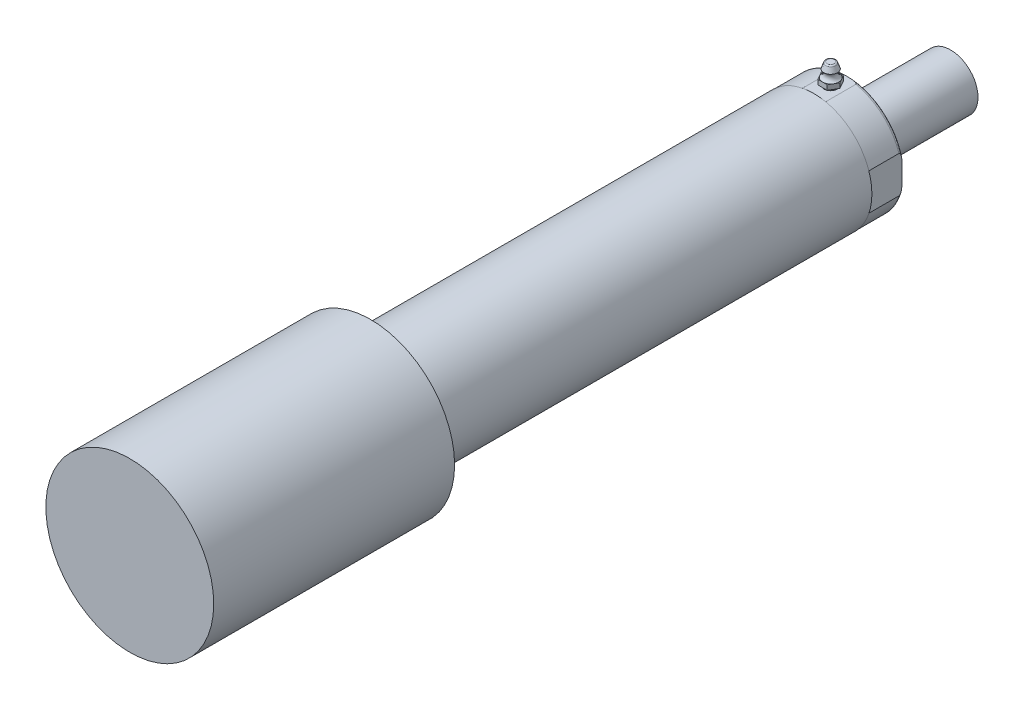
ISO-10303-21;
HEADER;
FILE_DESCRIPTION(('STEP AP214'),'2;1');
FILE_NAME('part.step','',(''),(''),'','','');
FILE_SCHEMA(('AUTOMOTIVE_DESIGN { 1 0 10303 214 1 1 1 1 }'));
ENDSEC;
DATA;
#1=APPLICATION_CONTEXT('core data for automotive mechanical design processes');
#2=APPLICATION_PROTOCOL_DEFINITION('international standard','automotive_design',2000,#1);
#3=PRODUCT_CONTEXT('',#1,'mechanical');
#4=PRODUCT('Part','Part','',(#3));
#5=PRODUCT_RELATED_PRODUCT_CATEGORY('part','',(#4));
#6=PRODUCT_DEFINITION_FORMATION('','',#4);
#7=PRODUCT_DEFINITION_CONTEXT('part definition',#1,'design');
#8=PRODUCT_DEFINITION('design','',#6,#7);
#9=PRODUCT_DEFINITION_SHAPE('','',#8);
#10=(LENGTH_UNIT() NAMED_UNIT(*) SI_UNIT(.MILLI.,.METRE.));
#11=(NAMED_UNIT(*) PLANE_ANGLE_UNIT() SI_UNIT($,.RADIAN.));
#12=(NAMED_UNIT(*) SI_UNIT($,.STERADIAN.) SOLID_ANGLE_UNIT());
#13=UNCERTAINTY_MEASURE_WITH_UNIT(LENGTH_MEASURE(1.E-05),#10,'distance_accuracy_value','');
#14=(GEOMETRIC_REPRESENTATION_CONTEXT(3) GLOBAL_UNCERTAINTY_ASSIGNED_CONTEXT((#13)) GLOBAL_UNIT_ASSIGNED_CONTEXT((#10,
#11,#12)) REPRESENTATION_CONTEXT('',''));
#15=CARTESIAN_POINT('',(0.,0.,0.));
#16=DIRECTION('',(0.,0.,1.));
#17=DIRECTION('',(1.,0.,0.));
#18=AXIS2_PLACEMENT_3D('',#15,#16,#17);
#19=CARTESIAN_POINT('',(0.,0.,-14.7828));
#20=DIRECTION('',(0.,0.,1.));
#21=DIRECTION('',(1.,0.,0.));
#22=AXIS2_PLACEMENT_3D('',#19,#20,#21);
#23=PLANE('',#22);
#24=CARTESIAN_POINT('',(0.,0.,-14.7828));
#25=DIRECTION('',(0.,0.,1.));
#26=DIRECTION('',(1.,0.,0.));
#27=AXIS2_PLACEMENT_3D('',#24,#25,#26);
#28=CIRCLE('',#27,28.56738);
#29=CARTESIAN_POINT('',(28.56738,0.,-14.7828));
#30=VERTEX_POINT('',#29);
#31=EDGE_CURVE('E10',#30,#30,#28,.F.);
#32=ORIENTED_EDGE('',*,*,#31,.F.);
#33=EDGE_LOOP('',(#32));
#34=FACE_BOUND('',#33,.T.);
#35=CARTESIAN_POINT('',(0.,0.,-14.7828));
#36=DIRECTION('',(0.,0.,1.));
#37=DIRECTION('',(1.,0.,0.));
#38=AXIS2_PLACEMENT_3D('',#35,#36,#37);
#39=CIRCLE('',#38,41.32961);
#40=CARTESIAN_POINT('',(41.32961,0.,-14.7828));
#41=VERTEX_POINT('',#40);
#42=EDGE_CURVE('E106',#41,#41,#39,.T.);
#43=ORIENTED_EDGE('',*,*,#42,.F.);
#44=EDGE_LOOP('',(#43));
#45=FACE_BOUND('',#44,.T.);
#46=ADVANCED_FACE('F16',(#34,#45),#23,.F.);
#47=CARTESIAN_POINT('',(0.,38.037384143,-241.25839999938));
#48=DIRECTION('',(0.,1.,0.));
#49=DIRECTION('',(0.,0.,1.));
#50=AXIS2_PLACEMENT_3D('',#47,#48,#49);
#51=PLANE('',#50);
#52=CARTESIAN_POINT('',(0.,38.037384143,-241.25839999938));
#53=DIRECTION('',(0.,1.,0.));
#54=DIRECTION('',(0.,0.,1.));
#55=AXIS2_PLACEMENT_3D('',#52,#53,#54);
#56=CIRCLE('',#55,1.7474960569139);
#57=CARTESIAN_POINT('',(0.,38.037384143,-239.510903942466));
#58=VERTEX_POINT('',#57);
#59=EDGE_CURVE('E665',#58,#58,#56,.T.);
#60=ORIENTED_EDGE('',*,*,#59,.T.);
#61=EDGE_LOOP('',(#60));
#62=FACE_BOUND('',#61,.T.);
#63=ADVANCED_FACE('F202',(#62),#51,.T.);
#64=CARTESIAN_POINT('',(0.,37.275384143,-241.25839999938));
#65=DIRECTION('',(0.,1.,0.));
#66=DIRECTION('',(0.,0.,1.));
#67=AXIS2_PLACEMENT_3D('',#64,#65,#66);
#68=TOROIDAL_SURFACE('',#67,1.7474960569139,0.762);
#69=ORIENTED_EDGE('',*,*,#59,.F.);
#70=EDGE_LOOP('',(#69));
#71=FACE_BOUND('',#70,.T.);
#72=CARTESIAN_POINT('',(0.,37.5297756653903,-241.25839999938));
#73=DIRECTION('',(0.,1.,0.));
#74=DIRECTION('',(0.,0.,1.));
#75=AXIS2_PLACEMENT_3D('',#72,#73,#74);
#76=CIRCLE('',#75,2.46577800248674);
#77=CARTESIAN_POINT('',(0.,37.5297756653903,-238.792621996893));
#78=VERTEX_POINT('',#77);
#79=EDGE_CURVE('E662',#78,#78,#76,.F.);
#80=ORIENTED_EDGE('',*,*,#79,.F.);
#81=EDGE_LOOP('',(#80));
#82=FACE_BOUND('',#81,.T.);
#83=ADVANCED_FACE('F198',(#71,#82),#68,.T.);
#84=CARTESIAN_POINT('',(0.,34.989384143,-241.25839999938));
#85=DIRECTION('',(0.,-1.,0.));
#86=DIRECTION('',(0.,0.,-1.));
#87=AXIS2_PLACEMENT_3D('',#84,#85,#86);
#88=CONICAL_SURFACE('',#87,3.3655,0.340381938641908);
#89=ORIENTED_EDGE('',*,*,#79,.T.);
#90=EDGE_LOOP('',(#89));
#91=FACE_BOUND('',#90,.T.);
#92=CARTESIAN_POINT('',(0.,34.989384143,-241.25839999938));
#93=DIRECTION('',(0.,-1.,0.));
#94=DIRECTION('',(0.,0.,-1.));
#95=AXIS2_PLACEMENT_3D('',#92,#93,#94);
#96=CIRCLE('',#95,3.3655);
#97=CARTESIAN_POINT('',(0.,34.989384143,-244.62389999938));
#98=VERTEX_POINT('',#97);
#99=EDGE_CURVE('E127',#98,#98,#96,.T.);
#100=ORIENTED_EDGE('',*,*,#99,.F.);
#101=EDGE_LOOP('',(#100));
#102=FACE_BOUND('',#101,.T.);
#103=ADVANCED_FACE('F201',(#91,#102),#88,.T.);
#104=CARTESIAN_POINT('',(0.,33.3910743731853,-241.25839999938));
#105=DIRECTION('',(0.,-1.,0.));
#106=DIRECTION('',(0.,0.,-1.));
#107=AXIS2_PLACEMENT_3D('',#104,#105,#106);
#108=TOROIDAL_SURFACE('',#107,5.20693450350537,2.43833450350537);
#109=ORIENTED_EDGE('',*,*,#99,.T.);
#110=EDGE_LOOP('',(#109));
#111=FACE_BOUND('',#110,.T.);
#112=CARTESIAN_POINT('',(0.,31.290509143,-241.25839999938));
#113=DIRECTION('',(0.,-1.,0.));
#114=DIRECTION('',(0.,0.,-1.));
#115=AXIS2_PLACEMENT_3D('',#112,#113,#114);
#116=CIRCLE('',#115,3.96875);
#117=CARTESIAN_POINT('',(0.,31.290509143,-245.22714999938));
#118=VERTEX_POINT('',#117);
#119=CARTESIAN_POINT('',(3.43703832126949,31.290509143,-243.24277499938));
#120=VERTEX_POINT('',#119);
#121=EDGE_CURVE('E35',#118,#120,#116,.T.);
#122=ORIENTED_EDGE('',*,*,#121,.F.);
#123=CARTESIAN_POINT('',(-3.43703832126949,31.290509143,-243.24277499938));
#124=VERTEX_POINT('',#123);
#125=EDGE_CURVE('E595',#124,#118,#116,.T.);
#126=ORIENTED_EDGE('',*,*,#125,.F.);
#127=CARTESIAN_POINT('',(-3.43703832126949,31.290509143,-239.27402499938));
#128=VERTEX_POINT('',#127);
#129=EDGE_CURVE('E589',#128,#124,#116,.T.);
#130=ORIENTED_EDGE('',*,*,#129,.F.);
#131=CARTESIAN_POINT('',(0.,31.290509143,-237.28964999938));
#132=VERTEX_POINT('',#131);
#133=EDGE_CURVE('E575',#132,#128,#116,.T.);
#134=ORIENTED_EDGE('',*,*,#133,.F.);
#135=CARTESIAN_POINT('',(3.43703832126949,31.290509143,-239.27402499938));
#136=VERTEX_POINT('',#135);
#137=EDGE_CURVE('E588',#136,#132,#116,.T.);
#138=ORIENTED_EDGE('',*,*,#137,.F.);
#139=EDGE_CURVE('E601',#120,#136,#116,.T.);
#140=ORIENTED_EDGE('',*,*,#139,.F.);
#141=EDGE_LOOP('',(#122,#126,#130,#134,#138,#140));
#142=FACE_BOUND('',#141,.T.);
#143=ADVANCED_FACE('F240',(#111,#142),#108,.F.);
#144=CARTESIAN_POINT('',(-2.29135888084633,31.290509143,-245.22714999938));
#145=DIRECTION('',(0.,1.,0.));
#146=DIRECTION('',(1.,0.,0.));
#147=AXIS2_PLACEMENT_3D('',#144,#145,#146);
#148=PLANE('',#147);
#149=ORIENTED_EDGE('',*,*,#129,.T.);
#150=DIRECTION('',(-0.5,0.,0.866025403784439));
#151=VECTOR('',#150,1.);
#152=CARTESIAN_POINT('',(-2.29135888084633,31.290509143,-245.22714999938));
#153=LINE('',#152,#151);
#154=CARTESIAN_POINT('',(-4.58271776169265,31.290509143,-241.25839999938));
#155=VERTEX_POINT('',#154);
#156=EDGE_CURVE('E610',#124,#155,#153,.T.);
#157=ORIENTED_EDGE('',*,*,#156,.T.);
#158=DIRECTION('',(0.5,0.,0.866025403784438));
#159=VECTOR('',#158,1.);
#160=CARTESIAN_POINT('',(-4.58271776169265,31.290509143,-241.25839999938));
#161=LINE('',#160,#159);
#162=EDGE_CURVE('E615',#155,#128,#161,.T.);
#163=ORIENTED_EDGE('',*,*,#162,.T.);
#164=EDGE_LOOP('',(#149,#157,#163));
#165=FACE_BOUND('',#164,.T.);
#166=ADVANCED_FACE('F236',(#165),#148,.T.);
#167=ORIENTED_EDGE('',*,*,#133,.T.);
#168=CARTESIAN_POINT('',(-2.29135888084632,31.290509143,-237.28964999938));
#169=VERTEX_POINT('',#168);
#170=EDGE_CURVE('E579',#128,#169,#161,.T.);
#171=ORIENTED_EDGE('',*,*,#170,.T.);
#172=DIRECTION('',(1.,0.,0.));
#173=VECTOR('',#172,1.);
#174=CARTESIAN_POINT('',(-2.29135888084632,31.290509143,-237.28964999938));
#175=LINE('',#174,#173);
#176=EDGE_CURVE('E582',#169,#132,#175,.T.);
#177=ORIENTED_EDGE('',*,*,#176,.T.);
#178=EDGE_LOOP('',(#167,#171,#177));
#179=FACE_BOUND('',#178,.T.);
#180=ADVANCED_FACE('F239',(#179),#148,.T.);
#181=ORIENTED_EDGE('',*,*,#137,.T.);
#182=CARTESIAN_POINT('',(2.29135888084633,31.290509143,-237.28964999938));
#183=VERTEX_POINT('',#182);
#184=EDGE_CURVE('E617',#132,#183,#175,.T.);
#185=ORIENTED_EDGE('',*,*,#184,.T.);
#186=DIRECTION('',(0.5,0.,-0.866025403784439));
#187=VECTOR('',#186,1.);
#188=CARTESIAN_POINT('',(2.29135888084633,31.290509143,-237.28964999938));
#189=LINE('',#188,#187);
#190=EDGE_CURVE('E620',#183,#136,#189,.T.);
#191=ORIENTED_EDGE('',*,*,#190,.T.);
#192=EDGE_LOOP('',(#181,#185,#191));
#193=FACE_BOUND('',#192,.T.);
#194=ADVANCED_FACE('F535',(#193),#148,.T.);
#195=ORIENTED_EDGE('',*,*,#139,.T.);
#196=CARTESIAN_POINT('',(4.58271776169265,31.290509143,-241.25839999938));
#197=VERTEX_POINT('',#196);
#198=EDGE_CURVE('E619',#136,#197,#189,.T.);
#199=ORIENTED_EDGE('',*,*,#198,.T.);
#200=DIRECTION('',(-0.5,0.,-0.866025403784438));
#201=VECTOR('',#200,1.);
#202=CARTESIAN_POINT('',(4.58271776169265,31.290509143,-241.25839999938));
#203=LINE('',#202,#201);
#204=EDGE_CURVE('E624',#197,#120,#203,.T.);
#205=ORIENTED_EDGE('',*,*,#204,.T.);
#206=EDGE_LOOP('',(#195,#199,#205));
#207=FACE_BOUND('',#206,.T.);
#208=ADVANCED_FACE('F528',(#207),#148,.T.);
#209=ORIENTED_EDGE('',*,*,#121,.T.);
#210=CARTESIAN_POINT('',(2.29135888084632,31.290509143,-245.22714999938));
#211=VERTEX_POINT('',#210);
#212=EDGE_CURVE('E623',#120,#211,#203,.T.);
#213=ORIENTED_EDGE('',*,*,#212,.T.);
#214=DIRECTION('',(-1.,0.,0.));
#215=VECTOR('',#214,1.);
#216=CARTESIAN_POINT('',(2.29135888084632,31.290509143,-245.22714999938));
#217=LINE('',#216,#215);
#218=EDGE_CURVE('E608',#211,#118,#217,.T.);
#219=ORIENTED_EDGE('',*,*,#218,.T.);
#220=EDGE_LOOP('',(#209,#213,#219));
#221=FACE_BOUND('',#220,.T.);
#222=ADVANCED_FACE('F521',(#221),#148,.T.);
#223=ORIENTED_EDGE('',*,*,#125,.T.);
#224=CARTESIAN_POINT('',(-2.29135888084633,31.290509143,-245.22714999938));
#225=VERTEX_POINT('',#224);
#226=EDGE_CURVE('E611',#118,#225,#217,.T.);
#227=ORIENTED_EDGE('',*,*,#226,.T.);
#228=EDGE_CURVE('E612',#225,#124,#153,.T.);
#229=ORIENTED_EDGE('',*,*,#228,.T.);
#230=EDGE_LOOP('',(#223,#227,#229));
#231=FACE_BOUND('',#230,.T.);
#232=ADVANCED_FACE('F215',(#231),#148,.T.);
#233=CARTESIAN_POINT('',(-2.29135888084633,31.290509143,-245.22714999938));
#234=DIRECTION('',(0.866025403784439,0.,0.5));
#235=DIRECTION('',(0.5,0.,-0.866025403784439));
#236=AXIS2_PLACEMENT_3D('',#233,#234,#235);
#237=PLANE('',#236);
#238=DIRECTION('',(-0.5,0.,0.866025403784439));
#239=VECTOR('',#238,1.);
#240=CARTESIAN_POINT('',(-2.29135888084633,28.909259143,-245.22714999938));
#241=LINE('',#240,#239);
#242=CARTESIAN_POINT('',(-2.29135888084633,28.909259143,-245.22714999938));
#243=VERTEX_POINT('',#242);
#244=CARTESIAN_POINT('',(-4.58271776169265,28.909259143,-241.25839999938));
#245=VERTEX_POINT('',#244);
#246=EDGE_CURVE('E630',#243,#245,#241,.T.);
#247=ORIENTED_EDGE('',*,*,#246,.T.);
#248=DIRECTION('',(0.,-1.,0.));
#249=VECTOR('',#248,1.);
#250=CARTESIAN_POINT('',(-4.58271776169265,31.290509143,-241.25839999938));
#251=LINE('',#250,#249);
#252=EDGE_CURVE('E656',#155,#245,#251,.T.);
#253=ORIENTED_EDGE('',*,*,#252,.F.);
#254=ORIENTED_EDGE('',*,*,#156,.F.);
#255=ORIENTED_EDGE('',*,*,#228,.F.);
#256=DIRECTION('',(0.,-1.,0.));
#257=VECTOR('',#256,1.);
#258=CARTESIAN_POINT('',(-2.29135888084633,31.290509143,-245.22714999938));
#259=LINE('',#258,#257);
#260=EDGE_CURVE('E659',#225,#243,#259,.T.);
#261=ORIENTED_EDGE('',*,*,#260,.T.);
#262=EDGE_LOOP('',(#247,#253,#254,#255,#261));
#263=FACE_BOUND('',#262,.T.);
#264=ADVANCED_FACE('F211',(#263),#237,.F.);
#265=CARTESIAN_POINT('',(-4.58271776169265,31.290509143,-241.25839999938));
#266=DIRECTION('',(0.866025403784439,0.,-0.5));
#267=DIRECTION('',(-0.5,0.,-0.866025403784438));
#268=AXIS2_PLACEMENT_3D('',#265,#266,#267);
#269=PLANE('',#268);
#270=DIRECTION('',(0.5,0.,0.866025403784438));
#271=VECTOR('',#270,1.);
#272=CARTESIAN_POINT('',(-4.58271776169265,28.909259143,-241.25839999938));
#273=LINE('',#272,#271);
#274=CARTESIAN_POINT('',(-2.29135888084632,28.909259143,-237.28964999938));
#275=VERTEX_POINT('',#274);
#276=EDGE_CURVE('E633',#245,#275,#273,.T.);
#277=ORIENTED_EDGE('',*,*,#276,.T.);
#278=DIRECTION('',(0.,-1.,0.));
#279=VECTOR('',#278,1.);
#280=CARTESIAN_POINT('',(-2.29135888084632,31.290509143,-237.28964999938));
#281=LINE('',#280,#279);
#282=EDGE_CURVE('E653',#169,#275,#281,.T.);
#283=ORIENTED_EDGE('',*,*,#282,.F.);
#284=ORIENTED_EDGE('',*,*,#170,.F.);
#285=ORIENTED_EDGE('',*,*,#162,.F.);
#286=ORIENTED_EDGE('',*,*,#252,.T.);
#287=EDGE_LOOP('',(#277,#283,#284,#285,#286));
#288=FACE_BOUND('',#287,.T.);
#289=ADVANCED_FACE('F214',(#288),#269,.F.);
#290=CARTESIAN_POINT('',(-2.29135888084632,31.290509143,-237.28964999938));
#291=DIRECTION('',(0.,0.,-1.));
#292=DIRECTION('',(-1.,0.,0.));
#293=AXIS2_PLACEMENT_3D('',#290,#291,#292);
#294=PLANE('',#293);
#295=DIRECTION('',(1.,0.,0.));
#296=VECTOR('',#295,1.);
#297=CARTESIAN_POINT('',(-2.29135888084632,28.909259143,-237.28964999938));
#298=LINE('',#297,#296);
#299=CARTESIAN_POINT('',(2.29135888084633,28.909259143,-237.28964999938));
#300=VERTEX_POINT('',#299);
#301=EDGE_CURVE('E636',#275,#300,#298,.T.);
#302=ORIENTED_EDGE('',*,*,#301,.T.);
#303=DIRECTION('',(0.,-1.,0.));
#304=VECTOR('',#303,1.);
#305=CARTESIAN_POINT('',(2.29135888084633,31.290509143,-237.28964999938));
#306=LINE('',#305,#304);
#307=EDGE_CURVE('E650',#183,#300,#306,.T.);
#308=ORIENTED_EDGE('',*,*,#307,.F.);
#309=ORIENTED_EDGE('',*,*,#184,.F.);
#310=ORIENTED_EDGE('',*,*,#176,.F.);
#311=ORIENTED_EDGE('',*,*,#282,.T.);
#312=EDGE_LOOP('',(#302,#308,#309,#310,#311));
#313=FACE_BOUND('',#312,.T.);
#314=ADVANCED_FACE('F219',(#313),#294,.F.);
#315=CARTESIAN_POINT('',(2.29135888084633,31.290509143,-237.28964999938));
#316=DIRECTION('',(-0.866025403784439,0.,-0.5));
#317=DIRECTION('',(-0.5,0.,0.866025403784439));
#318=AXIS2_PLACEMENT_3D('',#315,#316,#317);
#319=PLANE('',#318);
#320=DIRECTION('',(0.5,0.,-0.866025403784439));
#321=VECTOR('',#320,1.);
#322=CARTESIAN_POINT('',(2.29135888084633,28.909259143,-237.28964999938));
#323=LINE('',#322,#321);
#324=CARTESIAN_POINT('',(4.58271776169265,28.909259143,-241.25839999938));
#325=VERTEX_POINT('',#324);
#326=EDGE_CURVE('E639',#300,#325,#323,.T.);
#327=ORIENTED_EDGE('',*,*,#326,.T.);
#328=DIRECTION('',(0.,-1.,0.));
#329=VECTOR('',#328,1.);
#330=CARTESIAN_POINT('',(4.58271776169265,31.290509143,-241.25839999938));
#331=LINE('',#330,#329);
#332=EDGE_CURVE('E647',#197,#325,#331,.T.);
#333=ORIENTED_EDGE('',*,*,#332,.F.);
#334=ORIENTED_EDGE('',*,*,#198,.F.);
#335=ORIENTED_EDGE('',*,*,#190,.F.);
#336=ORIENTED_EDGE('',*,*,#307,.T.);
#337=EDGE_LOOP('',(#327,#333,#334,#335,#336));
#338=FACE_BOUND('',#337,.T.);
#339=ADVANCED_FACE('F223',(#338),#319,.F.);
#340=CARTESIAN_POINT('',(4.58271776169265,31.290509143,-241.25839999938));
#341=DIRECTION('',(-0.866025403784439,0.,0.5));
#342=DIRECTION('',(0.5,0.,0.866025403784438));
#343=AXIS2_PLACEMENT_3D('',#340,#341,#342);
#344=PLANE('',#343);
#345=DIRECTION('',(-0.5,0.,-0.866025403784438));
#346=VECTOR('',#345,1.);
#347=CARTESIAN_POINT('',(4.58271776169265,28.909259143,-241.25839999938));
#348=LINE('',#347,#346);
#349=CARTESIAN_POINT('',(2.29135888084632,28.909259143,-245.22714999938));
#350=VERTEX_POINT('',#349);
#351=EDGE_CURVE('E642',#325,#350,#348,.T.);
#352=ORIENTED_EDGE('',*,*,#351,.T.);
#353=DIRECTION('',(0.,-1.,0.));
#354=VECTOR('',#353,1.);
#355=CARTESIAN_POINT('',(2.29135888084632,31.290509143,-245.22714999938));
#356=LINE('',#355,#354);
#357=EDGE_CURVE('E627',#211,#350,#356,.T.);
#358=ORIENTED_EDGE('',*,*,#357,.F.);
#359=ORIENTED_EDGE('',*,*,#212,.F.);
#360=ORIENTED_EDGE('',*,*,#204,.F.);
#361=ORIENTED_EDGE('',*,*,#332,.T.);
#362=EDGE_LOOP('',(#352,#358,#359,#360,#361));
#363=FACE_BOUND('',#362,.T.);
#364=ADVANCED_FACE('F208',(#363),#344,.F.);
#365=CARTESIAN_POINT('',(2.29135888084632,31.290509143,-245.22714999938));
#366=DIRECTION('',(0.,0.,1.));
#367=DIRECTION('',(0.,-1.,0.));
#368=AXIS2_PLACEMENT_3D('',#365,#366,#367);
#369=PLANE('',#368);
#370=DIRECTION('',(-1.,0.,0.));
#371=VECTOR('',#370,1.);
#372=CARTESIAN_POINT('',(2.29135888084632,28.909259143,-245.22714999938));
#373=LINE('',#372,#371);
#374=EDGE_CURVE('E607',#350,#243,#373,.T.);
#375=ORIENTED_EDGE('',*,*,#374,.T.);
#376=ORIENTED_EDGE('',*,*,#260,.F.);
#377=ORIENTED_EDGE('',*,*,#226,.F.);
#378=ORIENTED_EDGE('',*,*,#218,.F.);
#379=ORIENTED_EDGE('',*,*,#357,.T.);
#380=EDGE_LOOP('',(#375,#376,#377,#378,#379));
#381=FACE_BOUND('',#380,.T.);
#382=ADVANCED_FACE('F204',(#381),#369,.F.);
#383=CARTESIAN_POINT('',(0.,13.5,-300.31339999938));
#384=DIRECTION('',(0.,0.,1.));
#385=DIRECTION('',(0.,1.,0.));
#386=AXIS2_PLACEMENT_3D('',#383,#384,#385);
#387=PLANE('',#386);
#388=CARTESIAN_POINT('',(0.,0.,-300.31339999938));
#389=DIRECTION('',(0.,0.,-1.));
#390=DIRECTION('',(0.,-1.,0.));
#391=AXIS2_PLACEMENT_3D('',#388,#389,#390);
#392=CIRCLE('',#391,13.5);
#393=CARTESIAN_POINT('',(0.,-13.5,-300.31339999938));
#394=VERTEX_POINT('',#393);
#395=EDGE_CURVE('E122',#394,#394,#392,.T.);
#396=ORIENTED_EDGE('',*,*,#395,.T.);
#397=EDGE_LOOP('',(#396));
#398=FACE_BOUND('',#397,.T.);
#399=ADVANCED_FACE('F207',(#398),#387,.F.);
#400=CARTESIAN_POINT('',(-2.29135888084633,28.909259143,-245.22714999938));
#401=DIRECTION('',(0.,1.,0.));
#402=DIRECTION('',(1.,0.,0.));
#403=AXIS2_PLACEMENT_3D('',#400,#401,#402);
#404=PLANE('',#403);
#405=CARTESIAN_POINT('',(0.,28.909259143,-241.25839999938));
#406=DIRECTION('',(0.,-1.,0.));
#407=DIRECTION('',(0.,0.,-1.));
#408=AXIS2_PLACEMENT_3D('',#405,#406,#407);
#409=CIRCLE('',#408,3.2385);
#410=CARTESIAN_POINT('',(0.,28.909259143,-244.49689999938));
#411=VERTEX_POINT('',#410);
#412=EDGE_CURVE('E600',#411,#411,#409,.T.);
#413=ORIENTED_EDGE('',*,*,#412,.F.);
#414=EDGE_LOOP('',(#413));
#415=FACE_BOUND('',#414,.T.);
#416=ORIENTED_EDGE('',*,*,#374,.F.);
#417=ORIENTED_EDGE('',*,*,#351,.F.);
#418=ORIENTED_EDGE('',*,*,#326,.F.);
#419=ORIENTED_EDGE('',*,*,#301,.F.);
#420=ORIENTED_EDGE('',*,*,#276,.F.);
#421=ORIENTED_EDGE('',*,*,#246,.F.);
#422=EDGE_LOOP('',(#416,#417,#418,#419,#420,#421));
#423=FACE_BOUND('',#422,.T.);
#424=ADVANCED_FACE('F210',(#415,#423),#404,.F.);
#425=CARTESIAN_POINT('',(0.,0.,-250.427612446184));
#426=DIRECTION('',(0.,0.,-1.));
#427=DIRECTION('',(0.,-1.,0.));
#428=AXIS2_PLACEMENT_3D('',#425,#426,#427);
#429=CYLINDRICAL_SURFACE('',#428,13.5);
#430=ORIENTED_EDGE('',*,*,#395,.F.);
#431=EDGE_LOOP('',(#430));
#432=FACE_BOUND('',#431,.T.);
#433=CARTESIAN_POINT('',(0.,0.,-249.51339999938));
#434=DIRECTION('',(0.,0.,-1.));
#435=DIRECTION('',(0.,-1.,0.));
#436=AXIS2_PLACEMENT_3D('',#433,#434,#435);
#437=CIRCLE('',#436,13.5);
#438=CARTESIAN_POINT('',(0.,-13.5,-249.51339999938));
#439=VERTEX_POINT('',#438);
#440=EDGE_CURVE('E118',#439,#439,#437,.T.);
#441=ORIENTED_EDGE('',*,*,#440,.T.);
#442=EDGE_LOOP('',(#441));
#443=FACE_BOUND('',#442,.T.);
#444=ADVANCED_FACE('F233',(#432,#443),#429,.T.);
#445=CARTESIAN_POINT('',(0.,28.909259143,-241.25839999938));
#446=DIRECTION('',(0.,-1.,0.));
#447=DIRECTION('',(0.,0.,-1.));
#448=AXIS2_PLACEMENT_3D('',#445,#446,#447);
#449=CYLINDRICAL_SURFACE('',#448,3.2385);
#450=ORIENTED_EDGE('',*,*,#412,.T.);
#451=EDGE_LOOP('',(#450));
#452=FACE_BOUND('',#451,.T.);
#453=CARTESIAN_POINT('',(0.,28.401259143,-241.25839999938));
#454=DIRECTION('',(0.,-1.,0.));
#455=DIRECTION('',(0.,0.,-1.));
#456=AXIS2_PLACEMENT_3D('',#453,#454,#455);
#457=CIRCLE('',#456,3.2385);
#458=CARTESIAN_POINT('',(0.,28.401259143,-244.49689999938));
#459=VERTEX_POINT('',#458);
#460=EDGE_CURVE('E604',#459,#459,#457,.T.);
#461=ORIENTED_EDGE('',*,*,#460,.F.);
#462=EDGE_LOOP('',(#461));
#463=FACE_BOUND('',#462,.T.);
#464=ADVANCED_FACE('F235',(#452,#463),#449,.T.);
#465=CARTESIAN_POINT('',(0.,13.5,-249.51339999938));
#466=DIRECTION('',(0.,0.,1.));
#467=DIRECTION('',(0.,1.,0.));
#468=AXIS2_PLACEMENT_3D('',#465,#466,#467);
#469=PLANE('',#468);
#470=CARTESIAN_POINT('',(0.,0.,-249.51339999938));
#471=DIRECTION('',(0.,0.,1.));
#472=DIRECTION('',(0.,1.,0.));
#473=AXIS2_PLACEMENT_3D('',#470,#471,#472);
#474=CIRCLE('',#473,26.8732);
#475=CARTESIAN_POINT('',(0.,26.8732,-249.51339999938));
#476=VERTEX_POINT('',#475);
#477=EDGE_CURVE('E111',#476,#476,#474,.F.);
#478=ORIENTED_EDGE('',*,*,#477,.T.);
#479=EDGE_LOOP('',(#478));
#480=FACE_BOUND('',#479,.T.);
#481=ORIENTED_EDGE('',*,*,#440,.F.);
#482=EDGE_LOOP('',(#481));
#483=FACE_BOUND('',#482,.T.);
#484=ADVANCED_FACE('F250',(#480,#483),#469,.F.);
#485=CARTESIAN_POINT('',(0.,24.146759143,-241.25839999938));
#486=DIRECTION('',(0.,1.,0.));
#487=DIRECTION('',(0.,0.,1.));
#488=AXIS2_PLACEMENT_3D('',#485,#486,#487);
#489=CONICAL_SURFACE('',#488,3.048,0.0447462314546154);
#490=ORIENTED_EDGE('',*,*,#460,.T.);
#491=EDGE_LOOP('',(#490));
#492=FACE_BOUND('',#491,.T.);
#493=CARTESIAN_POINT('',(0.,27.877384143,-241.25839999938));
#494=DIRECTION('',(0.,-1.,0.));
#495=DIRECTION('',(0.,0.,-1.));
#496=AXIS2_PLACEMENT_3D('',#493,#494,#495);
#497=CIRCLE('',#496,3.21504291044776);
#498=CARTESIAN_POINT('',(0.,27.877384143,-244.473442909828));
#499=VERTEX_POINT('',#498);
#500=EDGE_CURVE('E26',#499,#499,#497,.F.);
#501=ORIENTED_EDGE('',*,*,#500,.T.);
#502=EDGE_LOOP('',(#501));
#503=FACE_BOUND('',#502,.T.);
#504=ADVANCED_FACE('F197',(#492,#503),#489,.T.);
#505=CARTESIAN_POINT('',(0.,0.,-247.92589999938));
#506=DIRECTION('',(0.,0.,1.));
#507=DIRECTION('',(0.,1.,0.));
#508=AXIS2_PLACEMENT_3D('',#505,#506,#507);
#509=TOROIDAL_SURFACE('',#508,26.8732,1.5875);
#510=CARTESIAN_POINT('',(0.,27.877384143,-249.155440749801));
#511=CARTESIAN_POINT('',(0.265451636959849,27.877384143,-249.155444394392));
#512=CARTESIAN_POINT('',(0.530907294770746,27.8773841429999,-249.152373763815));
#513=CARTESIAN_POINT('',(1.0617612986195,27.8773841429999,-249.139756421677));
#514=CARTESIAN_POINT('',(1.32715958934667,27.8773841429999,-249.130207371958));
#515=CARTESIAN_POINT('',(1.85687288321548,27.8773841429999,-249.103595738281));
#516=CARTESIAN_POINT('',(2.12118885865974,27.8773841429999,-249.086553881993));
#517=CARTESIAN_POINT('',(2.51701883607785,27.8773841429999,-249.053770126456));
#518=CARTESIAN_POINT('',(2.64883358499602,27.8773841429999,-249.041641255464));
#519=CARTESIAN_POINT('',(2.91216948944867,27.8773841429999,-249.014552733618));
#520=CARTESIAN_POINT('',(3.04369065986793,27.877384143,-248.999593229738));
#521=CARTESIAN_POINT('',(3.30644207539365,27.877384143,-248.966278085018));
#522=CARTESIAN_POINT('',(3.43767189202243,27.8773841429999,-248.947919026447));
#523=CARTESIAN_POINT('',(3.69954531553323,27.8773841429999,-248.907032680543));
#524=CARTESIAN_POINT('',(3.83018867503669,27.8773841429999,-248.884503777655));
#525=CARTESIAN_POINT('',(4.09106564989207,27.8773841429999,-248.834027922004));
#526=CARTESIAN_POINT('',(4.2212945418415,27.8773841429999,-248.806056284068));
#527=CARTESIAN_POINT('',(4.47997147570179,27.8773841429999,-248.743022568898));
#528=CARTESIAN_POINT('',(4.60842108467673,27.877384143,-248.707967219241));
#529=CARTESIAN_POINT('',(4.79927752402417,27.8773841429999,-248.647480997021));
#530=CARTESIAN_POINT('',(4.86289331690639,27.8773841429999,-248.625879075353));
#531=CARTESIAN_POINT('',(4.98899922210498,27.8773841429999,-248.579322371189));
#532=CARTESIAN_POINT('',(5.0514878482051,27.8773841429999,-248.5543634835));
#533=CARTESIAN_POINT('',(5.17407169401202,27.8773841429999,-248.500334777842));
#534=CARTESIAN_POINT('',(5.23418227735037,27.8773841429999,-248.471300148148));
#535=CARTESIAN_POINT('',(5.35121093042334,27.8773841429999,-248.407465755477));
#536=CARTESIAN_POINT('',(5.40813744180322,27.877384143,-248.372682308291));
#537=CARTESIAN_POINT('',(5.49062571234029,27.8773841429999,-248.31297972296));
#538=CARTESIAN_POINT('',(5.51836475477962,27.8773841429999,-248.291096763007));
#539=CARTESIAN_POINT('',(5.57124738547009,27.8773841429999,-248.24431568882));
#540=CARTESIAN_POINT('',(5.59639184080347,27.877384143,-248.219418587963));
#541=CARTESIAN_POINT('',(5.63639683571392,27.8773841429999,-248.173043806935));
#542=CARTESIAN_POINT('',(5.65221770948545,27.8773841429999,-248.152405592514));
#543=CARTESIAN_POINT('',(5.68057732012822,27.8773841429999,-248.10896826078));
#544=CARTESIAN_POINT('',(5.69312260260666,27.877384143,-248.086173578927));
#545=CARTESIAN_POINT('',(5.7109872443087,27.8773841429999,-248.044673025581));
#546=CARTESIAN_POINT('',(5.71733435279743,27.8773841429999,-248.026415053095));
#547=CARTESIAN_POINT('',(5.72691174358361,27.8773841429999,-247.989100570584));
#548=CARTESIAN_POINT('',(5.73014607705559,27.877384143,-247.970045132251));
#549=CARTESIAN_POINT('',(5.73314750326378,27.877384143,-247.931569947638));
#550=CARTESIAN_POINT('',(5.73289923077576,27.8773841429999,-247.91214896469));
#551=CARTESIAN_POINT('',(5.72892948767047,27.8773841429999,-247.873663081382));
#552=CARTESIAN_POINT('',(5.72520527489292,27.8773841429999,-247.854598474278));
#553=CARTESIAN_POINT('',(5.71370799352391,27.877384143,-247.813864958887));
#554=CARTESIAN_POINT('',(5.70530791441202,27.8773841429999,-247.792375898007));
#555=CARTESIAN_POINT('',(5.68516123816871,27.8773841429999,-247.751037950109));
#556=CARTESIAN_POINT('',(5.67340817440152,27.8773841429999,-247.731192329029));
#557=CARTESIAN_POINT('',(5.63933893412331,27.877384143,-247.681279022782));
#558=CARTESIAN_POINT('',(5.61501828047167,27.8773841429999,-247.65259740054));
#559=CARTESIAN_POINT('',(5.56255217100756,27.8773841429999,-247.599018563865));
#560=CARTESIAN_POINT('',(5.53439592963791,27.8773841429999,-247.574132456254));
#561=CARTESIAN_POINT('',(5.46534305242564,27.877384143,-247.519119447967));
#562=CARTESIAN_POINT('',(5.42345975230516,27.8773841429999,-247.490247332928));
#563=CARTESIAN_POINT('',(5.33714322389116,27.8773841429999,-247.436545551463));
#564=CARTESIAN_POINT('',(5.2927049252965,27.8773841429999,-247.411724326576));
#565=CARTESIAN_POINT('',(5.20199850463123,27.8773841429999,-247.36508901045));
#566=CARTESIAN_POINT('',(5.15572197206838,27.8773841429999,-247.343291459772));
#567=CARTESIAN_POINT('',(5.06213183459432,27.8773841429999,-247.302221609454));
#568=CARTESIAN_POINT('',(5.01481929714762,27.8773841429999,-247.282946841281));
#569=CARTESIAN_POINT('',(4.88126731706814,27.877384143,-247.231802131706));
#570=CARTESIAN_POINT('',(4.79416529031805,27.8773841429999,-247.202191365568));
#571=CARTESIAN_POINT('',(4.6184696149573,27.8773841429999,-247.147728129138));
#572=CARTESIAN_POINT('',(4.52987505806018,27.8773841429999,-247.122878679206));
#573=CARTESIAN_POINT('',(4.35155017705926,27.8773841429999,-247.076837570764));
#574=CARTESIAN_POINT('',(4.26181785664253,27.8773841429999,-247.055653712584));
#575=CARTESIAN_POINT('',(4.08169419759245,27.8773841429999,-247.016279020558));
#576=CARTESIAN_POINT('',(3.99130276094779,27.8773841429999,-246.998088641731));
#577=CARTESIAN_POINT('',(3.71917682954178,27.8773841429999,-246.947153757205));
#578=CARTESIAN_POINT('',(3.53675037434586,27.8773841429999,-246.918108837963));
#579=CARTESIAN_POINT('',(3.17117821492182,27.8773841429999,-246.867193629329));
#580=CARTESIAN_POINT('',(2.98803371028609,27.877384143,-246.84531432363));
#581=CARTESIAN_POINT('',(2.62332299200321,27.877384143,-246.807306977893));
#582=CARTESIAN_POINT('',(2.44176338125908,27.8773841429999,-246.791114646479));
#583=CARTESIAN_POINT('',(2.07830071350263,27.8773841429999,-246.763105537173));
#584=CARTESIAN_POINT('',(1.89639763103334,27.8773841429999,-246.751289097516));
#585=CARTESIAN_POINT('',(1.53226828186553,27.8773841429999,-246.731348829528));
#586=CARTESIAN_POINT('',(1.35004187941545,27.8773841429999,-246.72322752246));
#587=CARTESIAN_POINT('',(0.985468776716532,27.8773841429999,-246.710247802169));
#588=CARTESIAN_POINT('',(0.803122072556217,27.8773841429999,-246.705389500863));
#589=CARTESIAN_POINT('',(0.438798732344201,27.8773841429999,-246.698689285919));
#590=CARTESIAN_POINT('',(0.25682222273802,27.8773841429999,-246.696840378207));
#591=CARTESIAN_POINT('',(-0.107137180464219,27.8773841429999,-246.6960422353));
#592=CARTESIAN_POINT('',(-0.289120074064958,27.8773841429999,-246.697093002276));
#593=CARTESIAN_POINT('',(-0.652977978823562,27.8773841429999,-246.702147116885));
#594=CARTESIAN_POINT('',(-0.83485300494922,27.8773841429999,-246.706149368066));
#595=CARTESIAN_POINT('',(-1.19850241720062,27.8773841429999,-246.717312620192));
#596=CARTESIAN_POINT('',(-1.38027680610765,27.877384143,-246.72447352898));
#597=CARTESIAN_POINT('',(-1.74338396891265,27.877384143,-246.742322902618));
#598=CARTESIAN_POINT('',(-1.92471699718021,27.8773841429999,-246.753006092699));
#599=CARTESIAN_POINT('',(-2.28711998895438,27.8773841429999,-246.778503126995));
#600=CARTESIAN_POINT('',(-2.46818991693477,27.8773841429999,-246.793317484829));
#601=CARTESIAN_POINT('',(-2.82996451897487,27.8773841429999,-246.827982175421));
#602=CARTESIAN_POINT('',(-3.01066892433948,27.8773841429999,-246.847835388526));
#603=CARTESIAN_POINT('',(-3.37122653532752,27.8773841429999,-246.893937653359));
#604=CARTESIAN_POINT('',(-3.55107993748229,27.8773841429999,-246.920185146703));
#605=CARTESIAN_POINT('',(-3.90975372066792,27.877384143,-246.981256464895));
#606=CARTESIAN_POINT('',(-4.08857149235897,27.8773841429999,-247.016096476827));
#607=CARTESIAN_POINT('',(-4.35448455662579,27.8773841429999,-247.077641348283));
#608=CARTESIAN_POINT('',(-4.4426563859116,27.8773841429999,-247.099679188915));
#609=CARTESIAN_POINT('',(-4.61791723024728,27.8773841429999,-247.147674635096));
#610=CARTESIAN_POINT('',(-4.70500661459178,27.877384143,-247.173630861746));
#611=CARTESIAN_POINT('',(-4.85840950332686,27.8773841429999,-247.224361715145));
#612=CARTESIAN_POINT('',(-4.92505489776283,27.8773841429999,-247.248126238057));
#613=CARTESIAN_POINT('',(-5.05695090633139,27.8773841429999,-247.299720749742));
#614=CARTESIAN_POINT('',(-5.12219839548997,27.877384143,-247.327558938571));
#615=CARTESIAN_POINT('',(-5.25062568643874,27.8773841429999,-247.388879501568));
#616=CARTESIAN_POINT('',(-5.31378554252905,27.8773841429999,-247.422403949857));
#617=CARTESIAN_POINT('',(-5.43540254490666,27.8773841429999,-247.497319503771));
#618=CARTESIAN_POINT('',(-5.49387347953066,27.877384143,-247.538686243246));
#619=CARTESIAN_POINT('',(-5.57192856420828,27.8773841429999,-247.608261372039));
#620=CARTESIAN_POINT('',(-5.59564757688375,27.8773841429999,-247.631756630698));
#621=CARTESIAN_POINT('',(-5.63937137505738,27.8773841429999,-247.681986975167));
#622=CARTESIAN_POINT('',(-5.65938804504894,27.877384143,-247.708711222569));
#623=CARTESIAN_POINT('',(-5.68710322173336,27.8773841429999,-247.754917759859));
#624=CARTESIAN_POINT('',(-5.69659645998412,27.8773841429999,-247.773312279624));
#625=CARTESIAN_POINT('',(-5.71261803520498,27.8773841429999,-247.811362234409));
#626=CARTESIAN_POINT('',(-5.71914946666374,27.877384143,-247.831016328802));
#627=CARTESIAN_POINT('',(-5.72861672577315,27.877384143,-247.871407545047));
#628=CARTESIAN_POINT('',(-5.73151582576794,27.8773841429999,-247.892153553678));
#629=CARTESIAN_POINT('',(-5.73319629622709,27.8773841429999,-247.933810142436));
#630=CARTESIAN_POINT('',(-5.73197960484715,27.877384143,-247.954720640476));
#631=CARTESIAN_POINT('',(-5.72600665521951,27.8773841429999,-247.993366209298));
#632=CARTESIAN_POINT('',(-5.72170502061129,27.8773841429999,-248.011175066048));
#633=CARTESIAN_POINT('',(-5.71048982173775,27.8773841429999,-248.045943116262));
#634=CARTESIAN_POINT('',(-5.7035745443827,27.8773841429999,-248.062901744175));
#635=CARTESIAN_POINT('',(-5.6829994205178,27.877384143,-248.105318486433));
#636=CARTESIAN_POINT('',(-5.66775393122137,27.8773841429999,-248.130002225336));
#637=CARTESIAN_POINT('',(-5.6336851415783,27.8773841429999,-248.176757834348));
#638=CARTESIAN_POINT('',(-5.6148509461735,27.8773841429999,-248.198821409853));
#639=CARTESIAN_POINT('',(-5.55692512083,27.877384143,-248.259371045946));
#640=CARTESIAN_POINT('',(-5.51478117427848,27.8773841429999,-248.294896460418));
#641=CARTESIAN_POINT('',(-5.42624563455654,27.8773841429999,-248.360072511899));
#642=CARTESIAN_POINT('',(-5.3798414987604,27.8773841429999,-248.389704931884));
#643=CARTESIAN_POINT('',(-5.2544285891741,27.877384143,-248.462131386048));
#644=CARTESIAN_POINT('',(-5.17338874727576,27.8773841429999,-248.501370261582));
#645=CARTESIAN_POINT('',(-5.00810203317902,27.8773841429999,-248.572526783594));
#646=CARTESIAN_POINT('',(-4.92384775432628,27.8773841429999,-248.604426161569));
#647=CARTESIAN_POINT('',(-4.75308331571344,27.8773841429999,-248.663055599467));
#648=CARTESIAN_POINT('',(-4.66656366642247,27.8773841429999,-248.689757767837));
#649=CARTESIAN_POINT('',(-4.49250203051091,27.8773841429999,-248.739054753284));
#650=CARTESIAN_POINT('',(-4.40496144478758,27.877384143,-248.761654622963));
#651=CARTESIAN_POINT('',(-4.22921418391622,27.877384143,-248.803608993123));
#652=CARTESIAN_POINT('',(-4.14100833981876,27.8773841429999,-248.822967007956));
#653=CARTESIAN_POINT('',(-3.96405638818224,27.8773841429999,-248.859048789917));
#654=CARTESIAN_POINT('',(-3.87531022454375,27.8773841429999,-248.875772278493));
#655=CARTESIAN_POINT('',(-3.60841712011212,27.8773841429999,-248.922666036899));
#656=CARTESIAN_POINT('',(-3.42969126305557,27.8773841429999,-248.949542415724));
#657=CARTESIAN_POINT('',(-3.07104917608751,27.8773841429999,-248.996848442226));
#658=CARTESIAN_POINT('',(-2.89113125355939,27.8773841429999,-249.017264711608));
#659=CARTESIAN_POINT('',(-2.53077859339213,27.8773841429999,-249.052974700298));
#660=CARTESIAN_POINT('',(-2.35034381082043,27.8773841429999,-249.068267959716));
#661=CARTESIAN_POINT('',(-1.98918194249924,27.8773841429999,-249.094664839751));
#662=CARTESIAN_POINT('',(-1.80845486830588,27.8773841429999,-249.105768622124));
#663=CARTESIAN_POINT('',(-1.44680913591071,27.8773841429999,-249.12440919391));
#664=CARTESIAN_POINT('',(-1.26589046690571,27.8773841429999,-249.131945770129));
#665=CARTESIAN_POINT('',(-0.904166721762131,27.8773841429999,-249.143845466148));
#666=CARTESIAN_POINT('',(-0.723361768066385,27.8773841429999,-249.148212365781));
#667=CARTESIAN_POINT('',(-0.361705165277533,27.8773841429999,-249.154008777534));
#668=CARTESIAN_POINT('',(-0.180853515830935,27.8773841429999,-249.155438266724));
#669=CARTESIAN_POINT('',(0.,27.877384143,-249.155440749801));
#670=B_SPLINE_CURVE_WITH_KNOTS('',3,(#510,#511,#512,#513,#514,#515,#516,#517,#518,#519,#520,
#521,#522,#523,#524,#525,#526,#527,#528,#529,#530,#531,#532,#533,#534,#535,#536,#537,#538,#539,
#540,#541,#542,#543,#544,#545,#546,#547,#548,#549,#550,#551,#552,#553,#554,#555,#556,#557,#558,
#559,#560,#561,#562,#563,#564,#565,#566,#567,#568,#569,#570,#571,#572,#573,#574,#575,#576,#577,
#578,#579,#580,#581,#582,#583,#584,#585,#586,#587,#588,#589,#590,#591,#592,#593,#594,#595,#596,
#597,#598,#599,#600,#601,#602,#603,#604,#605,#606,#607,#608,#609,#610,#611,#612,#613,#614,#615,
#616,#617,#618,#619,#620,#621,#622,#623,#624,#625,#626,#627,#628,#629,#630,#631,#632,#633,#634,
#635,#636,#637,#638,#639,#640,#641,#642,#643,#644,#645,#646,#647,#648,#649,#650,#651,#652,#653,
#654,#655,#656,#657,#658,#659,#660,#661,#662,#663,#664,#665,#666,#667,#668,#669),.UNSPECIFIED.,
.T.,.F.,(4,2,2,2,2,2,2,2,2,2,2,2,2,2,2,2,2,2,2,2,2,2,2,2,2,2,2,2,2,2,2,2,2,2,2,2,2,2,2,2,2,2,2,
2,2,2,2,2,2,2,2,2,2,2,2,2,2,2,2,2,2,2,2,2,2,2,2,2,2,2,2,2,2,2,2,2,2,2,2,4),(0.,
0.796341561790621,1.59297068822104,2.38740979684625,2.78450105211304,3.18157169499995,
3.57904372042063,3.97667006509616,4.3761437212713,4.77523975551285,4.9767255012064,
5.17845992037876,5.37854902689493,5.57807971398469,5.6839294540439,5.78974370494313,
5.86754736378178,5.94519433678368,6.00295588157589,6.06064214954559,6.11858300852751,
6.17656961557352,6.2454020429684,6.31436813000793,6.42654493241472,6.53904394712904,
6.69128933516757,6.84384804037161,6.997210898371,7.15042255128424,7.42619901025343,
7.70214983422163,7.97868084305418,8.25525384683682,8.80920045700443,9.36244734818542,
9.90922160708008,10.4560381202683,11.003227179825,11.5504350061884,12.0963692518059,
12.6423039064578,13.188035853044,13.7337518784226,14.2786543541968,14.8236246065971,
15.3689070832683,15.9140567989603,16.4602414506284,16.7328314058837,17.0053256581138,
17.2175058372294,17.4301191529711,17.6443803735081,17.8579864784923,17.9579154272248,
18.0575178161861,18.1194185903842,18.1812545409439,18.2437108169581,18.3061376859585,
18.3608722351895,18.4156427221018,18.502176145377,18.5889765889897,18.7534080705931,
18.9183402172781,19.1877629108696,19.4578491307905,19.7293470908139,20.0005083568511,
20.2713737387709,20.5422677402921,21.0842883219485,21.6274241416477,22.1706087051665,
22.7137722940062,23.256968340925,23.7995155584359,24.3420670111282),.UNSPECIFIED.);
#671=CARTESIAN_POINT('',(-5.73261701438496,27.877384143,-247.92589999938));
#672=VERTEX_POINT('',#671);
#673=CARTESIAN_POINT('',(5.73261701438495,27.877384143,-247.92589999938));
#674=VERTEX_POINT('',#673);
#675=EDGE_CURVE('E88',#672,#674,#670,.T.);
#676=ORIENTED_EDGE('',*,*,#675,.T.);
#677=CARTESIAN_POINT('',(0.,0.,-247.92589999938));
#678=DIRECTION('',(0.,0.,1.));
#679=DIRECTION('',(0.,1.,0.));
#680=AXIS2_PLACEMENT_3D('',#677,#678,#679);
#681=CIRCLE('',#680,28.4607);
#682=CARTESIAN_POINT('',(26.9875,9.03804670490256,-247.92589999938));
#683=VERTEX_POINT('',#682);
#684=EDGE_CURVE('E20',#683,#674,#681,.T.);
#685=ORIENTED_EDGE('',*,*,#684,.F.);
#686=CARTESIAN_POINT('',(26.9875,0.,-249.509279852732));
#687=CARTESIAN_POINT('',(26.9875,-0.264568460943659,-249.509279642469));
#688=CARTESIAN_POINT('',(26.9875,-0.529136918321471,-249.509013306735));
#689=CARTESIAN_POINT('',(26.9875,-1.05827355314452,-249.507775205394));
#690=CARTESIAN_POINT('',(26.9875,-1.32284173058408,-249.506803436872));
#691=CARTESIAN_POINT('',(26.9875,-1.85203539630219,-249.503636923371));
#692=CARTESIAN_POINT('',(26.9875,-2.11666088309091,-249.50144188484));
#693=CARTESIAN_POINT('',(26.9875,-2.64586893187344,-249.494958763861));
#694=CARTESIAN_POINT('',(26.9875,-2.9104514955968,-249.490670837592));
#695=CARTESIAN_POINT('',(26.9875,-3.44002359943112,-249.478747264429));
#696=CARTESIAN_POINT('',(26.9875,-3.70501301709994,-249.471105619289));
#697=CARTESIAN_POINT('',(26.9875,-4.23478949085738,-249.45077759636));
#698=CARTESIAN_POINT('',(26.9875,-4.49957655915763,-249.438091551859));
#699=CARTESIAN_POINT('',(26.9875,-5.028663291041,-249.405415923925));
#700=CARTESIAN_POINT('',(26.9875,-5.29296306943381,-249.385428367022));
#701=CARTESIAN_POINT('',(26.9875,-5.68862195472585,-249.347562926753));
#702=CARTESIAN_POINT('',(26.9875,-5.82035736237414,-249.333629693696));
#703=CARTESIAN_POINT('',(26.9875,-6.08345029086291,-249.302585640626));
#704=CARTESIAN_POINT('',(26.9875,-6.21480783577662,-249.285475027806));
#705=CARTESIAN_POINT('',(26.9875,-6.47736534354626,-249.247352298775));
#706=CARTESIAN_POINT('',(26.9875,-6.60856364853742,-249.226328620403));
#707=CARTESIAN_POINT('',(26.9875,-6.87016522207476,-249.179525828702));
#708=CARTESIAN_POINT('',(26.9875,-7.00056823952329,-249.153745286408));
#709=CARTESIAN_POINT('',(26.9875,-7.26021989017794,-249.09620055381));
#710=CARTESIAN_POINT('',(26.9875,-7.38946702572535,-249.064429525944));
#711=CARTESIAN_POINT('',(26.9875,-7.64581187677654,-248.993231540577));
#712=CARTESIAN_POINT('',(26.9875,-7.77291107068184,-248.953810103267));
#713=CARTESIAN_POINT('',(26.9875,-7.96123091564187,-248.886752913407));
#714=CARTESIAN_POINT('',(26.9875,-8.02382757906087,-248.862983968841));
#715=CARTESIAN_POINT('',(26.9875,-8.14772649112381,-248.812301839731));
#716=CARTESIAN_POINT('',(26.9875,-8.20902916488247,-248.785389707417));
#717=CARTESIAN_POINT('',(26.9875,-8.32956661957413,-248.727877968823));
#718=CARTESIAN_POINT('',(26.9875,-8.38880929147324,-248.697295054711));
#719=CARTESIAN_POINT('',(26.9875,-8.50461995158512,-248.631472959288));
#720=CARTESIAN_POINT('',(26.9875,-8.56119106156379,-248.596239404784));
#721=CARTESIAN_POINT('',(26.9875,-8.65250387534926,-248.532260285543));
#722=CARTESIAN_POINT('',(26.9875,-8.68836700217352,-248.505125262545));
#723=CARTESIAN_POINT('',(26.9875,-8.75751412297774,-248.447603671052));
#724=CARTESIAN_POINT('',(26.9875,-8.79079447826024,-248.417212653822));
#725=CARTESIAN_POINT('',(26.9875,-8.85385730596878,-248.35234719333));
#726=CARTESIAN_POINT('',(26.9875,-8.88360231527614,-248.31783566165));
#727=CARTESIAN_POINT('',(26.9875,-8.93727164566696,-248.244526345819));
#728=CARTESIAN_POINT('',(26.9875,-8.96121132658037,-248.205740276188));
#729=CARTESIAN_POINT('',(26.9875,-8.99420280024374,-248.137328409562));
#730=CARTESIAN_POINT('',(26.9875,-9.0055643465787,-248.108826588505));
#731=CARTESIAN_POINT('',(26.9875,-9.02350937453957,-248.050354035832));
#732=CARTESIAN_POINT('',(26.9875,-9.0300987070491,-248.020385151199));
#733=CARTESIAN_POINT('',(26.9875,-9.0378466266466,-247.959558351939));
#734=CARTESIAN_POINT('',(26.9875,-9.0389736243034,-247.928696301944));
#735=CARTESIAN_POINT('',(26.9875,-9.03557431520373,-247.867281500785));
#736=CARTESIAN_POINT('',(26.9875,-9.03104589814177,-247.836728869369));
#737=CARTESIAN_POINT('',(26.9875,-9.0173262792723,-247.778875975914));
#738=CARTESIAN_POINT('',(26.9875,-9.0084662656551,-247.751494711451));
#739=CARTESIAN_POINT('',(26.9875,-8.98698721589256,-247.698269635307));
#740=CARTESIAN_POINT('',(26.9875,-8.97436671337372,-247.672426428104));
#741=CARTESIAN_POINT('',(26.9875,-8.9362817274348,-247.605065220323));
#742=CARTESIAN_POINT('',(26.9875,-8.90799057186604,-247.56515283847));
#743=CARTESIAN_POINT('',(26.9875,-8.84570732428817,-247.490041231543));
#744=CARTESIAN_POINT('',(26.9875,-8.81169589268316,-247.454858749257));
#745=CARTESIAN_POINT('',(26.9875,-8.74171715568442,-247.390253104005));
#746=CARTESIAN_POINT('',(26.9875,-8.70593048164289,-247.36063085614));
#747=CARTESIAN_POINT('',(26.9875,-8.63197258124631,-247.304498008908));
#748=CARTESIAN_POINT('',(26.9875,-8.59379908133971,-247.277990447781));
#749=CARTESIAN_POINT('',(26.9875,-8.51568842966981,-247.227575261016));
#750=CARTESIAN_POINT('',(26.9875,-8.47574813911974,-247.20367254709));
#751=CARTESIAN_POINT('',(26.9875,-8.39462713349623,-247.158137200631));
#752=CARTESIAN_POINT('',(26.9875,-8.35344693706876,-247.136503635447));
#753=CARTESIAN_POINT('',(26.9875,-8.24616120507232,-247.083276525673));
#754=CARTESIAN_POINT('',(26.9875,-8.17934667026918,-247.053113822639));
#755=CARTESIAN_POINT('',(26.9875,-8.04409523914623,-246.996645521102));
#756=CARTESIAN_POINT('',(26.9875,-7.97565749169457,-246.970342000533));
#757=CARTESIAN_POINT('',(26.9875,-7.76841146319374,-246.896096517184));
#758=CARTESIAN_POINT('',(26.9875,-7.62789703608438,-246.852925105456));
#759=CARTESIAN_POINT('',(26.9875,-7.34369059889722,-246.7754907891));
#760=CARTESIAN_POINT('',(26.9875,-7.19998518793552,-246.741279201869));
#761=CARTESIAN_POINT('',(26.9875,-6.98342108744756,-246.69525115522));
#762=CARTESIAN_POINT('',(26.9875,-6.91110963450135,-246.680797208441));
#763=CARTESIAN_POINT('',(26.9875,-6.766196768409,-246.653444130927));
#764=CARTESIAN_POINT('',(26.9875,-6.69359536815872,-246.640544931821));
#765=CARTESIAN_POINT('',(26.9875,-6.45717392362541,-246.60083568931));
#766=CARTESIAN_POINT('',(26.9875,-6.29288346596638,-246.576815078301));
#767=CARTESIAN_POINT('',(26.9875,-5.96359341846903,-246.534180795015));
#768=CARTESIAN_POINT('',(26.9875,-5.79859369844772,-246.515568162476));
#769=CARTESIAN_POINT('',(26.9875,-5.46807040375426,-246.482623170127));
#770=CARTESIAN_POINT('',(26.9875,-5.30254656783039,-246.468293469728));
#771=CARTESIAN_POINT('',(26.9875,-4.97123432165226,-246.443063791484));
#772=CARTESIAN_POINT('',(26.9875,-4.80544589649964,-246.432164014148));
#773=CARTESIAN_POINT('',(26.9875,-4.3069588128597,-246.403484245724));
#774=CARTESIAN_POINT('',(26.9875,-3.97402771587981,-246.389804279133));
#775=CARTESIAN_POINT('',(26.9875,-3.30810641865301,-246.369159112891));
#776=CARTESIAN_POINT('',(26.9875,-2.97511627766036,-246.362191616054));
#777=CARTESIAN_POINT('',(26.9875,-2.30924332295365,-246.352127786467));
#778=CARTESIAN_POINT('',(26.9875,-1.9763605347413,-246.349029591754));
#779=CARTESIAN_POINT('',(26.9875,-1.31056056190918,-246.344819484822));
#780=CARTESIAN_POINT('',(26.9875,-0.977643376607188,-246.343707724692));
#781=CARTESIAN_POINT('',(26.9875,-0.312250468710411,-246.342482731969));
#782=CARTESIAN_POINT('',(26.9875,0.0202252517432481,-246.342368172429));
#783=CARTESIAN_POINT('',(26.9875,0.685168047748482,-246.343008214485));
#784=CARTESIAN_POINT('',(26.9875,1.01763512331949,-246.343762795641));
#785=CARTESIAN_POINT('',(26.9875,1.67971415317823,-246.346861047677));
#786=CARTESIAN_POINT('',(26.9875,2.00932615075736,-246.349191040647));
#787=CARTESIAN_POINT('',(26.9875,2.66862924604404,-246.356990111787));
#788=CARTESIAN_POINT('',(26.9875,2.99832033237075,-246.362460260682));
#789=CARTESIAN_POINT('',(26.9875,3.65759522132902,-246.378986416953));
#790=CARTESIAN_POINT('',(26.9875,3.98717902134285,-246.390042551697));
#791=CARTESIAN_POINT('',(26.9875,4.48119418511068,-246.413527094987));
#792=CARTESIAN_POINT('',(26.9875,4.64578688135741,-246.422503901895));
#793=CARTESIAN_POINT('',(26.9875,4.97478521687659,-246.443368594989));
#794=CARTESIAN_POINT('',(26.9875,5.13919086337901,-246.455256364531));
#795=CARTESIAN_POINT('',(26.9875,5.46826346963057,-246.482715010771));
#796=CARTESIAN_POINT('',(26.9875,5.63292941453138,-246.498298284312));
#797=CARTESIAN_POINT('',(26.9875,5.96180196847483,-246.534061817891));
#798=CARTESIAN_POINT('',(26.9875,6.12600849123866,-246.55424288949));
#799=CARTESIAN_POINT('',(26.9875,6.45326382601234,-246.6003763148));
#800=CARTESIAN_POINT('',(26.9875,6.61631436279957,-246.626316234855));
#801=CARTESIAN_POINT('',(26.9875,6.94103437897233,-246.685645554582));
#802=CARTESIAN_POINT('',(26.9875,7.10270438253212,-246.719031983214));
#803=CARTESIAN_POINT('',(26.9875,7.37714618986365,-246.784632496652));
#804=CARTESIAN_POINT('',(26.9875,7.49050411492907,-246.814379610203));
#805=CARTESIAN_POINT('',(26.9875,7.71569037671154,-246.88031037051));
#806=CARTESIAN_POINT('',(26.9875,7.82751427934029,-246.916509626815));
#807=CARTESIAN_POINT('',(26.9875,7.99851549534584,-246.979136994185));
#808=CARTESIAN_POINT('',(26.9875,8.05876230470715,-247.002642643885));
#809=CARTESIAN_POINT('',(26.9875,8.17797683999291,-247.052683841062));
#810=CARTESIAN_POINT('',(26.9875,8.23694496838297,-247.079218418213));
#811=CARTESIAN_POINT('',(26.9875,8.35289719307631,-247.135849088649));
#812=CARTESIAN_POINT('',(26.9875,8.40988771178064,-247.165931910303));
#813=CARTESIAN_POINT('',(26.9875,8.52125218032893,-247.230558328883));
#814=CARTESIAN_POINT('',(26.9875,8.5756291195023,-247.265096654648));
#815=CARTESIAN_POINT('',(26.9875,8.664419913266,-247.328420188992));
#816=CARTESIAN_POINT('',(26.9875,8.69986555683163,-247.355748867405));
#817=CARTESIAN_POINT('',(26.9875,8.76809842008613,-247.413681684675));
#818=CARTESIAN_POINT('',(26.9875,8.80088214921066,-247.444290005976));
#819=CARTESIAN_POINT('',(26.9875,8.86285061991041,-247.509629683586));
#820=CARTESIAN_POINT('',(26.9875,8.89199457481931,-247.544400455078));
#821=CARTESIAN_POINT('',(26.9875,8.94428267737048,-247.618215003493));
#822=CARTESIAN_POINT('',(26.9875,8.9674435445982,-247.657246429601));
#823=CARTESIAN_POINT('',(26.9875,8.9989134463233,-247.725873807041));
#824=CARTESIAN_POINT('',(26.9875,9.00960222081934,-247.754369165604));
#825=CARTESIAN_POINT('',(26.9875,9.02617332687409,-247.812726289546));
#826=CARTESIAN_POINT('',(26.9875,9.0320614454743,-247.842586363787));
#827=CARTESIAN_POINT('',(26.9875,9.03843990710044,-247.903044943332));
#828=CARTESIAN_POINT('',(26.9875,9.03890293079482,-247.933646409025));
#829=CARTESIAN_POINT('',(26.9875,9.03430425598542,-247.99443514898));
#830=CARTESIAN_POINT('',(26.9875,9.02923988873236,-248.024622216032));
#831=CARTESIAN_POINT('',(26.9875,9.01456698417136,-248.082034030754));
#832=CARTESIAN_POINT('',(26.9875,9.0052291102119,-248.109329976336));
#833=CARTESIAN_POINT('',(26.9875,8.98286174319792,-248.16234240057));
#834=CARTESIAN_POINT('',(26.9875,8.96983090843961,-248.188058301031));
#835=CARTESIAN_POINT('',(26.9875,8.9302276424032,-248.255918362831));
#836=CARTESIAN_POINT('',(26.9875,8.90071685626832,-248.296340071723));
#837=CARTESIAN_POINT('',(26.9875,8.83595603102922,-248.372305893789));
#838=CARTESIAN_POINT('',(26.9875,8.80068612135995,-248.407832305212));
#839=CARTESIAN_POINT('',(26.9875,8.72786668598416,-248.473353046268));
#840=CARTESIAN_POINT('',(26.9875,8.69046068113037,-248.503509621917));
#841=CARTESIAN_POINT('',(26.9875,8.61322993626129,-248.560581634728));
#842=CARTESIAN_POINT('',(26.9875,8.5734028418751,-248.587493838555));
#843=CARTESIAN_POINT('',(26.9875,8.4919645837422,-248.638624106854));
#844=CARTESIAN_POINT('',(26.9875,8.45035011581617,-248.662836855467));
#845=CARTESIAN_POINT('',(26.9875,8.3658770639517,-248.708916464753));
#846=CARTESIAN_POINT('',(26.9875,8.32301902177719,-248.730784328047));
#847=CARTESIAN_POINT('',(26.9875,8.21049563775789,-248.784978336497));
#848=CARTESIAN_POINT('',(26.9875,8.14008868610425,-248.815762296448));
#849=CARTESIAN_POINT('',(26.9875,7.99762370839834,-248.873276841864));
#850=CARTESIAN_POINT('',(26.9875,7.92556480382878,-248.90000521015));
#851=CARTESIAN_POINT('',(26.9875,7.78016878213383,-248.950160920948));
#852=CARTESIAN_POINT('',(26.9875,7.70682957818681,-248.973582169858));
#853=CARTESIAN_POINT('',(26.9875,7.5593054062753,-249.017606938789));
#854=CARTESIAN_POINT('',(26.9875,7.48512029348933,-249.038209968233));
#855=CARTESIAN_POINT('',(26.9875,7.26088809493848,-249.096628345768));
#856=CARTESIAN_POINT('',(26.9875,7.10989387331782,-249.13081190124));
#857=CARTESIAN_POINT('',(26.9875,6.80668121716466,-249.191883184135));
#858=CARTESIAN_POINT('',(26.9875,6.65446451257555,-249.21877981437));
#859=CARTESIAN_POINT('',(26.9875,6.36785380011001,-249.26396382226));
#860=CARTESIAN_POINT('',(26.9875,6.23356088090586,-249.282902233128));
#861=CARTESIAN_POINT('',(26.9875,5.96451726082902,-249.31720600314));
#862=CARTESIAN_POINT('',(26.9875,5.82976652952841,-249.332571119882));
#863=CARTESIAN_POINT('',(26.9875,5.42496854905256,-249.374276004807));
#864=CARTESIAN_POINT('',(26.9875,5.15446949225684,-249.396211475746));
#865=CARTESIAN_POINT('',(26.9875,4.61251823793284,-249.432033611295));
#866=CARTESIAN_POINT('',(26.9875,4.34106520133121,-249.445906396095));
#867=CARTESIAN_POINT('',(26.9875,3.79792144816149,-249.468089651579));
#868=CARTESIAN_POINT('',(26.9875,3.52623071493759,-249.476399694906));
#869=CARTESIAN_POINT('',(26.9875,2.98324140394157,-249.48933435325));
#870=CARTESIAN_POINT('',(26.9875,2.71194296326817,-249.493965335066));
#871=CARTESIAN_POINT('',(26.9875,2.16930859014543,-249.500944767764));
#872=CARTESIAN_POINT('',(26.9875,1.89797265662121,-249.50329312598));
#873=CARTESIAN_POINT('',(26.9875,1.35552944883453,-249.506667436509));
#874=CARTESIAN_POINT('',(26.9875,1.08442218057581,-249.507694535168));
#875=CARTESIAN_POINT('',(26.9875,0.542209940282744,-249.509000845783));
#876=CARTESIAN_POINT('',(26.9875,0.271104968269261,-249.50928006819));
#877=CARTESIAN_POINT('',(26.9875,0.,-249.509279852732));
#878=B_SPLINE_CURVE_WITH_KNOTS('',3,(#686,#687,#688,#689,#690,#691,#692,#693,#694,#695,#696,
#697,#698,#699,#700,#701,#702,#703,#704,#705,#706,#707,#708,#709,#710,#711,#712,#713,#714,#715,
#716,#717,#718,#719,#720,#721,#722,#723,#724,#725,#726,#727,#728,#729,#730,#731,#732,#733,#734,
#735,#736,#737,#738,#739,#740,#741,#742,#743,#744,#745,#746,#747,#748,#749,#750,#751,#752,#753,
#754,#755,#756,#757,#758,#759,#760,#761,#762,#763,#764,#765,#766,#767,#768,#769,#770,#771,#772,
#773,#774,#775,#776,#777,#778,#779,#780,#781,#782,#783,#784,#785,#786,#787,#788,#789,#790,#791,
#792,#793,#794,#795,#796,#797,#798,#799,#800,#801,#802,#803,#804,#805,#806,#807,#808,#809,#810,
#811,#812,#813,#814,#815,#816,#817,#818,#819,#820,#821,#822,#823,#824,#825,#826,#827,#828,#829,
#830,#831,#832,#833,#834,#835,#836,#837,#838,#839,#840,#841,#842,#843,#844,#845,#846,#847,#848,
#849,#850,#851,#852,#853,#854,#855,#856,#857,#858,#859,#860,#861,#862,#863,#864,#865,#866,#867,
#868,#869,#870,#871,#872,#873,#874,#875,#876,#877),.UNSPECIFIED.,.T.,.F.,(4,2,2,2,2,2,2,2,2,2,2,
2,2,2,2,2,2,2,2,2,2,2,2,2,2,2,2,2,2,2,2,2,2,2,2,2,2,2,2,2,2,2,2,2,2,2,2,2,2,2,2,2,2,2,2,2,2,2,2,
2,2,2,2,2,2,2,2,2,2,2,2,2,2,2,2,2,2,2,2,2,2,2,2,2,2,2,2,2,2,2,2,2,2,2,2,4),(0.,
0.793705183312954,1.58741364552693,2.3813126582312,3.17515243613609,3.97041784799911,
4.76563072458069,5.56062305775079,5.95800372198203,6.35535848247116,6.75390652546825,
7.15257448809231,7.55170027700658,7.95053913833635,8.15134673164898,8.35208729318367,
8.5519473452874,8.75156776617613,8.88634081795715,9.02130041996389,9.15758222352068,
9.29349941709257,9.38520725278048,9.4768024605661,9.56892674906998,9.6610854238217,
9.74709651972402,9.83314119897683,9.97905776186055,10.1254779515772,10.2646371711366,
10.4039310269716,10.5434831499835,10.6829776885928,10.9027304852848,11.1226011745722,
11.563089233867,12.0060475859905,12.2272580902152,12.4484588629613,12.9464376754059,
13.444512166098,13.9428952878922,14.4413075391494,15.4408095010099,16.4399692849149,
17.4386480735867,18.4374033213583,19.4348293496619,20.4322319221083,21.4210842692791,
22.410273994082,23.3994862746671,23.8939785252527,24.388450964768,24.8846062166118,
25.380849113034,25.8760308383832,26.3710153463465,26.7224774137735,27.0748016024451,
27.2687479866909,27.4626324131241,27.655813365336,27.848767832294,27.9828925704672,
28.1171904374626,28.2528790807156,28.3881843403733,28.4791406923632,28.569987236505,
28.6612910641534,28.7526389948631,28.8388659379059,28.9251242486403,29.0743963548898,
29.2241948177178,29.368122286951,29.5121920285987,29.6565406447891,29.8008272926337,
30.0311781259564,30.261654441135,30.4925500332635,30.7234857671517,31.1876579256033,
31.6512603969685,32.0580675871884,32.4649023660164,33.2788566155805,34.094207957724,
34.9096219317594,35.7236216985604,36.5376545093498,37.3509805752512,38.1642952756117),.UNSPECIFIED.);
#879=CARTESIAN_POINT('',(26.9875,-9.03804670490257,-247.92589999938));
#880=VERTEX_POINT('',#879);
#881=EDGE_CURVE('E133',#683,#880,#878,.T.);
#882=ORIENTED_EDGE('',*,*,#881,.T.);
#883=CARTESIAN_POINT('',(-26.9875,-9.03804670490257,-247.92589999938));
#884=VERTEX_POINT('',#883);
#885=EDGE_CURVE('E107',#884,#880,#681,.T.);
#886=ORIENTED_EDGE('',*,*,#885,.F.);
#887=CARTESIAN_POINT('',(-26.9875,0.,-249.509279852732));
#888=CARTESIAN_POINT('',(-26.9875,0.264568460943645,-249.509279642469));
#889=CARTESIAN_POINT('',(-26.9875,0.529136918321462,-249.509013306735));
#890=CARTESIAN_POINT('',(-26.9875,1.05827355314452,-249.507775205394));
#891=CARTESIAN_POINT('',(-26.9875,1.32284173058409,-249.506803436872));
#892=CARTESIAN_POINT('',(-26.9875,1.85203539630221,-249.503636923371));
#893=CARTESIAN_POINT('',(-26.9875,2.11666088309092,-249.50144188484));
#894=CARTESIAN_POINT('',(-26.9875,2.64586893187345,-249.494958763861));
#895=CARTESIAN_POINT('',(-26.9875,2.9104514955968,-249.490670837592));
#896=CARTESIAN_POINT('',(-26.9875,3.44002359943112,-249.478747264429));
#897=CARTESIAN_POINT('',(-26.9875,3.70501301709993,-249.471105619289));
#898=CARTESIAN_POINT('',(-26.9875,4.23478949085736,-249.45077759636));
#899=CARTESIAN_POINT('',(-26.9875,4.49957655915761,-249.438091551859));
#900=CARTESIAN_POINT('',(-26.9875,5.02866329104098,-249.405415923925));
#901=CARTESIAN_POINT('',(-26.9875,5.29296306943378,-249.385428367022));
#902=CARTESIAN_POINT('',(-26.9875,5.68862195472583,-249.347562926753));
#903=CARTESIAN_POINT('',(-26.9875,5.82035736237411,-249.333629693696));
#904=CARTESIAN_POINT('',(-26.9875,6.08345029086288,-249.302585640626));
#905=CARTESIAN_POINT('',(-26.9875,6.21480783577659,-249.285475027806));
#906=CARTESIAN_POINT('',(-26.9875,6.47736534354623,-249.247352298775));
#907=CARTESIAN_POINT('',(-26.9875,6.60856364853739,-249.226328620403));
#908=CARTESIAN_POINT('',(-26.9875,6.87016522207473,-249.179525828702));
#909=CARTESIAN_POINT('',(-26.9875,7.00056823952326,-249.153745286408));
#910=CARTESIAN_POINT('',(-26.9875,7.26021989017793,-249.09620055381));
#911=CARTESIAN_POINT('',(-26.9875,7.38946702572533,-249.064429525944));
#912=CARTESIAN_POINT('',(-26.9875,7.64581187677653,-248.993231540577));
#913=CARTESIAN_POINT('',(-26.9875,7.77291107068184,-248.953810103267));
#914=CARTESIAN_POINT('',(-26.9875,7.96123091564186,-248.886752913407));
#915=CARTESIAN_POINT('',(-26.9875,8.02382757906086,-248.862983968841));
#916=CARTESIAN_POINT('',(-26.9875,8.1477264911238,-248.812301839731));
#917=CARTESIAN_POINT('',(-26.9875,8.20902916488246,-248.785389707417));
#918=CARTESIAN_POINT('',(-26.9875,8.32956661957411,-248.727877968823));
#919=CARTESIAN_POINT('',(-26.9875,8.38880929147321,-248.697295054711));
#920=CARTESIAN_POINT('',(-26.9875,8.50461995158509,-248.631472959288));
#921=CARTESIAN_POINT('',(-26.9875,8.56119106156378,-248.596239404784));
#922=CARTESIAN_POINT('',(-26.9875,8.65250387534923,-248.532260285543));
#923=CARTESIAN_POINT('',(-26.9875,8.68836700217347,-248.505125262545));
#924=CARTESIAN_POINT('',(-26.9875,8.7575141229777,-248.447603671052));
#925=CARTESIAN_POINT('',(-26.9875,8.79079447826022,-248.417212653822));
#926=CARTESIAN_POINT('',(-26.9875,8.85385730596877,-248.35234719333));
#927=CARTESIAN_POINT('',(-26.9875,8.8836023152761,-248.31783566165));
#928=CARTESIAN_POINT('',(-26.9875,8.93727164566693,-248.244526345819));
#929=CARTESIAN_POINT('',(-26.9875,8.96121132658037,-248.205740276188));
#930=CARTESIAN_POINT('',(-26.9875,8.99420280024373,-248.137328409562));
#931=CARTESIAN_POINT('',(-26.9875,9.00556434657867,-248.108826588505));
#932=CARTESIAN_POINT('',(-26.9875,9.02350937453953,-248.050354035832));
#933=CARTESIAN_POINT('',(-26.9875,9.03009870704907,-248.020385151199));
#934=CARTESIAN_POINT('',(-26.9875,9.03784662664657,-247.959558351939));
#935=CARTESIAN_POINT('',(-26.9875,9.03897362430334,-247.928696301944));
#936=CARTESIAN_POINT('',(-26.9875,9.03557431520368,-247.867281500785));
#937=CARTESIAN_POINT('',(-26.9875,9.03104589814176,-247.836728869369));
#938=CARTESIAN_POINT('',(-26.9875,9.01732627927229,-247.778875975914));
#939=CARTESIAN_POINT('',(-26.9875,9.00846626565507,-247.751494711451));
#940=CARTESIAN_POINT('',(-26.9875,8.98698721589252,-247.698269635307));
#941=CARTESIAN_POINT('',(-26.9875,8.97436671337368,-247.672426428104));
#942=CARTESIAN_POINT('',(-26.9875,8.93628172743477,-247.605065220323));
#943=CARTESIAN_POINT('',(-26.9875,8.907990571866,-247.56515283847));
#944=CARTESIAN_POINT('',(-26.9875,8.84570732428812,-247.490041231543));
#945=CARTESIAN_POINT('',(-26.9875,8.81169589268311,-247.454858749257));
#946=CARTESIAN_POINT('',(-26.9875,8.74171715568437,-247.390253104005));
#947=CARTESIAN_POINT('',(-26.9875,8.70593048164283,-247.36063085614));
#948=CARTESIAN_POINT('',(-26.9875,8.63197258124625,-247.304498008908));
#949=CARTESIAN_POINT('',(-26.9875,8.59379908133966,-247.277990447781));
#950=CARTESIAN_POINT('',(-26.9875,8.51568842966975,-247.227575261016));
#951=CARTESIAN_POINT('',(-26.9875,8.47574813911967,-247.20367254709));
#952=CARTESIAN_POINT('',(-26.9875,8.39462713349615,-247.158137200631));
#953=CARTESIAN_POINT('',(-26.9875,8.35344693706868,-247.136503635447));
#954=CARTESIAN_POINT('',(-26.9875,8.24616120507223,-247.083276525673));
#955=CARTESIAN_POINT('',(-26.9875,8.17934667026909,-247.053113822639));
#956=CARTESIAN_POINT('',(-26.9875,8.04409523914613,-246.996645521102));
#957=CARTESIAN_POINT('',(-26.9875,7.97565749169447,-246.970342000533));
#958=CARTESIAN_POINT('',(-26.9875,7.76841146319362,-246.896096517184));
#959=CARTESIAN_POINT('',(-26.9875,7.62789703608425,-246.852925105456));
#960=CARTESIAN_POINT('',(-26.9875,7.34369059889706,-246.7754907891));
#961=CARTESIAN_POINT('',(-26.9875,7.19998518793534,-246.741279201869));
#962=CARTESIAN_POINT('',(-26.9875,6.98342108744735,-246.69525115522));
#963=CARTESIAN_POINT('',(-26.9875,6.91110963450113,-246.680797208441));
#964=CARTESIAN_POINT('',(-26.9875,6.76619676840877,-246.653444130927));
#965=CARTESIAN_POINT('',(-26.9875,6.69359536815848,-246.640544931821));
#966=CARTESIAN_POINT('',(-26.9875,6.45717392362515,-246.60083568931));
#967=CARTESIAN_POINT('',(-26.9875,6.29288346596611,-246.576815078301));
#968=CARTESIAN_POINT('',(-26.9875,5.96359341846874,-246.534180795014));
#969=CARTESIAN_POINT('',(-26.9875,5.7985936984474,-246.515568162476));
#970=CARTESIAN_POINT('',(-26.9875,5.46807040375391,-246.482623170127));
#971=CARTESIAN_POINT('',(-26.9875,5.30254656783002,-246.468293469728));
#972=CARTESIAN_POINT('',(-26.9875,4.97123432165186,-246.443063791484));
#973=CARTESIAN_POINT('',(-26.9875,4.80544589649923,-246.432164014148));
#974=CARTESIAN_POINT('',(-26.9875,4.30695881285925,-246.403484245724));
#975=CARTESIAN_POINT('',(-26.9875,3.97402771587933,-246.389804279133));
#976=CARTESIAN_POINT('',(-26.9875,3.30810641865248,-246.369159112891));
#977=CARTESIAN_POINT('',(-26.9875,2.9751162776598,-246.362191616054));
#978=CARTESIAN_POINT('',(-26.9875,2.30924332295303,-246.352127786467));
#979=CARTESIAN_POINT('',(-26.9875,1.97636053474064,-246.349029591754));
#980=CARTESIAN_POINT('',(-26.9875,1.31056056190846,-246.344819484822));
#981=CARTESIAN_POINT('',(-26.9875,0.977643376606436,-246.343707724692));
#982=CARTESIAN_POINT('',(-26.9875,0.312250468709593,-246.342482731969));
#983=CARTESIAN_POINT('',(-26.9875,-0.0202252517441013,-246.342368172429));
#984=CARTESIAN_POINT('',(-26.9875,-0.685168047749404,-246.343008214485));
#985=CARTESIAN_POINT('',(-26.9875,-1.01763512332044,-246.343762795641));
#986=CARTESIAN_POINT('',(-26.9875,-1.67971415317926,-246.346861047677));
#987=CARTESIAN_POINT('',(-26.9875,-2.00932615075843,-246.349191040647));
#988=CARTESIAN_POINT('',(-26.9875,-2.6686292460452,-246.356990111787));
#989=CARTESIAN_POINT('',(-26.9875,-2.99832033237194,-246.362460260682));
#990=CARTESIAN_POINT('',(-26.9875,-3.65759522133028,-246.378986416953));
#991=CARTESIAN_POINT('',(-26.9875,-3.98717902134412,-246.390042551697));
#992=CARTESIAN_POINT('',(-26.9875,-4.48119418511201,-246.413527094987));
#993=CARTESIAN_POINT('',(-26.9875,-4.64578688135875,-246.422503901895));
#994=CARTESIAN_POINT('',(-26.9875,-4.97478521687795,-246.443368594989));
#995=CARTESIAN_POINT('',(-26.9875,-5.13919086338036,-246.455256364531));
#996=CARTESIAN_POINT('',(-26.9875,-5.46826346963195,-246.482715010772));
#997=CARTESIAN_POINT('',(-26.9875,-5.63292941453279,-246.498298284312));
#998=CARTESIAN_POINT('',(-26.9875,-5.96180196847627,-246.534061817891));
#999=CARTESIAN_POINT('',(-26.9875,-6.12600849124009,-246.55424288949));
#1000=CARTESIAN_POINT('',(-26.9875,-6.4532638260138,-246.6003763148));
#1001=CARTESIAN_POINT('',(-26.9875,-6.61631436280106,-246.626316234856));
#1002=CARTESIAN_POINT('',(-26.9875,-6.94103437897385,-246.685645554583));
#1003=CARTESIAN_POINT('',(-26.9875,-7.10270438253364,-246.719031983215));
#1004=CARTESIAN_POINT('',(-26.9875,-7.3771461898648,-246.784632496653));
#1005=CARTESIAN_POINT('',(-26.9875,-7.49050411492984,-246.814379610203));
#1006=CARTESIAN_POINT('',(-26.9875,-7.71569037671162,-246.88031037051));
#1007=CARTESIAN_POINT('',(-26.9875,-7.82751427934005,-246.916509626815));
#1008=CARTESIAN_POINT('',(-26.9875,-7.99851549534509,-246.979136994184));
#1009=CARTESIAN_POINT('',(-26.9875,-8.05876230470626,-247.002642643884));
#1010=CARTESIAN_POINT('',(-26.9875,-8.1779768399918,-247.052683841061));
#1011=CARTESIAN_POINT('',(-26.9875,-8.23694496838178,-247.079218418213));
#1012=CARTESIAN_POINT('',(-26.9875,-8.35289719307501,-247.135849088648));
#1013=CARTESIAN_POINT('',(-26.9875,-8.4098877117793,-247.165931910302));
#1014=CARTESIAN_POINT('',(-26.9875,-8.52125218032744,-247.230558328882));
#1015=CARTESIAN_POINT('',(-26.9875,-8.5756291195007,-247.265096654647));
#1016=CARTESIAN_POINT('',(-26.9875,-8.66441991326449,-247.328420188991));
#1017=CARTESIAN_POINT('',(-26.9875,-8.69986555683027,-247.355748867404));
#1018=CARTESIAN_POINT('',(-26.9875,-8.76809842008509,-247.413681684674));
#1019=CARTESIAN_POINT('',(-26.9875,-8.80088214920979,-247.444290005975));
#1020=CARTESIAN_POINT('',(-26.9875,-8.86285061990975,-247.509629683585));
#1021=CARTESIAN_POINT('',(-26.9875,-8.89199457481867,-247.544400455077));
#1022=CARTESIAN_POINT('',(-26.9875,-8.94428267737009,-247.618215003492));
#1023=CARTESIAN_POINT('',(-26.9875,-8.96744354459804,-247.6572464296));
#1024=CARTESIAN_POINT('',(-26.9875,-8.9989134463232,-247.725873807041));
#1025=CARTESIAN_POINT('',(-26.9875,-9.00960222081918,-247.754369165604));
#1026=CARTESIAN_POINT('',(-26.9875,-9.02617332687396,-247.812726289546));
#1027=CARTESIAN_POINT('',(-26.9875,-9.03206144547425,-247.842586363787));
#1028=CARTESIAN_POINT('',(-26.9875,-9.03843990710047,-247.903044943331));
#1029=CARTESIAN_POINT('',(-26.9875,-9.03890293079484,-247.933646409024));
#1030=CARTESIAN_POINT('',(-26.9875,-9.03430425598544,-247.994435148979));
#1031=CARTESIAN_POINT('',(-26.9875,-9.02923988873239,-248.024622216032));
#1032=CARTESIAN_POINT('',(-26.9875,-9.01456698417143,-248.082034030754));
#1033=CARTESIAN_POINT('',(-26.9875,-9.00522911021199,-248.109329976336));
#1034=CARTESIAN_POINT('',(-26.9875,-8.98286174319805,-248.16234240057));
#1035=CARTESIAN_POINT('',(-26.9875,-8.96983090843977,-248.188058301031));
#1036=CARTESIAN_POINT('',(-26.9875,-8.93022764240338,-248.255918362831));
#1037=CARTESIAN_POINT('',(-26.9875,-8.90071685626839,-248.296340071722));
#1038=CARTESIAN_POINT('',(-26.9875,-8.83595603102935,-248.372305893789));
#1039=CARTESIAN_POINT('',(-26.9875,-8.80068612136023,-248.407832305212));
#1040=CARTESIAN_POINT('',(-26.9875,-8.72786668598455,-248.473353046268));
#1041=CARTESIAN_POINT('',(-26.9875,-8.69046068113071,-248.503509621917));
#1042=CARTESIAN_POINT('',(-26.9875,-8.61322993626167,-248.560581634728));
#1043=CARTESIAN_POINT('',(-26.9875,-8.57340284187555,-248.587493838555));
#1044=CARTESIAN_POINT('',(-26.9875,-8.49196458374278,-248.638624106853));
#1045=CARTESIAN_POINT('',(-26.9875,-8.45035011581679,-248.662836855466));
#1046=CARTESIAN_POINT('',(-26.9875,-8.3658770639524,-248.708916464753));
#1047=CARTESIAN_POINT('',(-26.9875,-8.32301902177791,-248.730784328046));
#1048=CARTESIAN_POINT('',(-26.9875,-8.21049563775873,-248.784978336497));
#1049=CARTESIAN_POINT('',(-26.9875,-8.1400886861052,-248.815762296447));
#1050=CARTESIAN_POINT('',(-26.9875,-7.99762370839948,-248.873276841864));
#1051=CARTESIAN_POINT('',(-26.9875,-7.92556480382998,-248.90000521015));
#1052=CARTESIAN_POINT('',(-26.9875,-7.78016878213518,-248.950160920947));
#1053=CARTESIAN_POINT('',(-26.9875,-7.70682957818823,-248.973582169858));
#1054=CARTESIAN_POINT('',(-26.9875,-7.55930540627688,-249.017606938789));
#1055=CARTESIAN_POINT('',(-26.9875,-7.48512029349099,-249.038209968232));
#1056=CARTESIAN_POINT('',(-26.9875,-7.26088809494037,-249.096628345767));
#1057=CARTESIAN_POINT('',(-26.9875,-7.10989387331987,-249.13081190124));
#1058=CARTESIAN_POINT('',(-26.9875,-6.8066812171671,-249.191883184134));
#1059=CARTESIAN_POINT('',(-26.9875,-6.65446451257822,-249.21877981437));
#1060=CARTESIAN_POINT('',(-26.9875,-6.36785380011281,-249.263963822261));
#1061=CARTESIAN_POINT('',(-26.9875,-6.23356088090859,-249.282902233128));
#1062=CARTESIAN_POINT('',(-26.9875,-5.96451726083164,-249.317206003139));
#1063=CARTESIAN_POINT('',(-26.9875,-5.829766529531,-249.332571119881));
#1064=CARTESIAN_POINT('',(-26.9875,-5.42496854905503,-249.374276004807));
#1065=CARTESIAN_POINT('',(-26.9875,-5.15446949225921,-249.396211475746));
#1066=CARTESIAN_POINT('',(-26.9875,-4.612518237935,-249.432033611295));
#1067=CARTESIAN_POINT('',(-26.9875,-4.34106520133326,-249.445906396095));
#1068=CARTESIAN_POINT('',(-26.9875,-3.79792144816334,-249.468089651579));
#1069=CARTESIAN_POINT('',(-26.9875,-3.52623071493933,-249.476399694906));
#1070=CARTESIAN_POINT('',(-26.9875,-2.98324140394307,-249.48933435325));
#1071=CARTESIAN_POINT('',(-26.9875,-2.71194296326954,-249.493965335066));
#1072=CARTESIAN_POINT('',(-26.9875,-2.16930859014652,-249.500944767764));
#1073=CARTESIAN_POINT('',(-26.9875,-1.89797265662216,-249.50329312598));
#1074=CARTESIAN_POINT('',(-26.9875,-1.35552944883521,-249.506667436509));
#1075=CARTESIAN_POINT('',(-26.9875,-1.08442218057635,-249.507694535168));
#1076=CARTESIAN_POINT('',(-26.9875,-0.542209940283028,-249.509000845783));
#1077=CARTESIAN_POINT('',(-26.9875,-0.271104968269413,-249.509280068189));
#1078=CARTESIAN_POINT('',(-26.9875,0.,-249.509279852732));
#1079=B_SPLINE_CURVE_WITH_KNOTS('',3,(#887,#888,#889,#890,#891,#892,#893,#894,#895,#896,#897,
#898,#899,#900,#901,#902,#903,#904,#905,#906,#907,#908,#909,#910,#911,#912,#913,#914,#915,#916,
#917,#918,#919,#920,#921,#922,#923,#924,#925,#926,#927,#928,#929,#930,#931,#932,#933,#934,#935,
#936,#937,#938,#939,#940,#941,#942,#943,#944,#945,#946,#947,#948,#949,#950,#951,#952,#953,#954,
#955,#956,#957,#958,#959,#960,#961,#962,#963,#964,#965,#966,#967,#968,#969,#970,#971,#972,#973,
#974,#975,#976,#977,#978,#979,#980,#981,#982,#983,#984,#985,#986,#987,#988,#989,#990,#991,#992,
#993,#994,#995,#996,#997,#998,#999,#1000,#1001,#1002,#1003,#1004,#1005,#1006,#1007,#1008,#1009,
#1010,#1011,#1012,#1013,#1014,#1015,#1016,#1017,#1018,#1019,#1020,#1021,#1022,#1023,#1024,#1025,
#1026,#1027,#1028,#1029,#1030,#1031,#1032,#1033,#1034,#1035,#1036,#1037,#1038,#1039,#1040,#1041,
#1042,#1043,#1044,#1045,#1046,#1047,#1048,#1049,#1050,#1051,#1052,#1053,#1054,#1055,#1056,#1057,
#1058,#1059,#1060,#1061,#1062,#1063,#1064,#1065,#1066,#1067,#1068,#1069,#1070,#1071,#1072,#1073,
#1074,#1075,#1076,#1077,#1078),.UNSPECIFIED.,.T.,.F.,(4,2,2,2,2,2,2,2,2,2,2,2,2,2,2,2,2,2,2,2,2,
2,2,2,2,2,2,2,2,2,2,2,2,2,2,2,2,2,2,2,2,2,2,2,2,2,2,2,2,2,2,2,2,2,2,2,2,2,2,2,2,2,2,2,2,2,2,2,2,
2,2,2,2,2,2,2,2,2,2,2,2,2,2,2,2,2,2,2,2,2,2,2,2,2,2,4),(0.,0.79370518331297,1.58741364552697,
2.38131265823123,3.17515243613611,3.97041784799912,4.76563072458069,5.56062305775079,
5.95800372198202,6.35535848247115,6.75390652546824,7.15257448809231,7.55170027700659,
7.95053913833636,8.151346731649,8.35208729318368,8.55194734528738,8.75156776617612,
8.88634081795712,9.02130041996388,9.15758222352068,9.29349941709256,9.38520725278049,
9.47680246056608,9.56892674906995,9.66108542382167,9.747096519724,9.83314119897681,
9.97905776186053,10.1254779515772,10.2646371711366,10.4039310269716,10.5434831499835,
10.6829776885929,10.9027304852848,11.1226011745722,11.5630892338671,12.0060475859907,
12.2272580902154,12.4484588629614,12.9464376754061,13.4445121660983,13.9428952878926,
14.4413075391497,15.4408095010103,16.4399692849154,17.4386480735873,18.437403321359,
19.4348293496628,20.4322319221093,21.4210842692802,22.4102739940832,23.3994862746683,
23.893978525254,24.3884509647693,24.8846062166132,25.3808491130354,25.8760308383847,
26.3710153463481,26.7224774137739,27.0748016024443,27.2687479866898,27.4626324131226,
27.6558133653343,27.848767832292,27.9828925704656,28.1171904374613,28.2528790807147,
28.3881843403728,28.4791406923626,28.5699872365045,28.6612910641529,28.7526389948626,
28.8388659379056,28.9251242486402,29.0743963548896,29.2241948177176,29.3681222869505,
29.5121920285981,29.6565406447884,29.8008272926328,30.0311781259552,30.2616544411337,
30.4925500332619,30.7234857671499,31.187657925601,31.6512603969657,32.0580675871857,
32.4649023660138,33.2788566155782,34.094207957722,34.9096219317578,35.7236216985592,
36.537654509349,37.3509805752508,38.1642952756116),.UNSPECIFIED.);
#1080=CARTESIAN_POINT('',(-26.9875,9.03804670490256,-247.92589999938));
#1081=VERTEX_POINT('',#1080);
#1082=EDGE_CURVE('E161',#884,#1081,#1079,.T.);
#1083=ORIENTED_EDGE('',*,*,#1082,.T.);
#1084=EDGE_CURVE('E78',#672,#1081,#681,.T.);
#1085=ORIENTED_EDGE('',*,*,#1084,.F.);
#1086=EDGE_LOOP('',(#676,#685,#882,#886,#1083,#1085));
#1087=FACE_BOUND('',#1086,.T.);
#1088=ORIENTED_EDGE('',*,*,#477,.F.);
#1089=EDGE_LOOP('',(#1088));
#1090=FACE_BOUND('',#1089,.T.);
#1091=ADVANCED_FACE('F18',(#1087,#1090),#509,.T.);
#1092=CARTESIAN_POINT('',(5.73261701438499,27.8773841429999,-173.43939999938));
#1093=DIRECTION('',(0.,-1.,0.));
#1094=DIRECTION('',(0.,0.,1.));
#1095=AXIS2_PLACEMENT_3D('',#1092,#1093,#1094);
#1096=PLANE('',#1095);
#1097=ORIENTED_EDGE('',*,*,#500,.F.);
#1098=EDGE_LOOP('',(#1097));
#1099=FACE_BOUND('',#1098,.T.);
#1100=DIRECTION('',(-1.,0.,0.));
#1101=VECTOR('',#1100,1.);
#1102=CARTESIAN_POINT('',(0.,27.877384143,-233.00339999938));
#1103=LINE('',#1102,#1101);
#1104=CARTESIAN_POINT('',(5.73261701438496,27.877384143,-233.00339999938));
#1105=VERTEX_POINT('',#1104);
#1106=CARTESIAN_POINT('',(-5.73261701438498,27.877384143,-233.00339999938));
#1107=VERTEX_POINT('',#1106);
#1108=EDGE_CURVE('E89',#1105,#1107,#1103,.T.);
#1109=ORIENTED_EDGE('',*,*,#1108,.F.);
#1110=DIRECTION('',(0.,0.,-1.));
#1111=VECTOR('',#1110,1.);
#1112=CARTESIAN_POINT('',(5.73261701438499,27.8773841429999,-173.43939999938));
#1113=LINE('',#1112,#1111);
#1114=EDGE_CURVE('E84',#1105,#674,#1113,.T.);
#1115=ORIENTED_EDGE('',*,*,#1114,.T.);
#1116=ORIENTED_EDGE('',*,*,#675,.F.);
#1117=DIRECTION('',(0.,0.,-1.));
#1118=VECTOR('',#1117,1.);
#1119=CARTESIAN_POINT('',(-5.73261701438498,27.8773841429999,-173.43939999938));
#1120=LINE('',#1119,#1118);
#1121=EDGE_CURVE('E93',#1107,#672,#1120,.T.);
#1122=ORIENTED_EDGE('',*,*,#1121,.F.);
#1123=EDGE_LOOP('',(#1109,#1115,#1116,#1122));
#1124=FACE_BOUND('',#1123,.T.);
#1125=ADVANCED_FACE('F86',(#1099,#1124),#1096,.F.);
#1126=CARTESIAN_POINT('',(0.,0.,-250.427612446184));
#1127=DIRECTION('',(0.,0.,-1.));
#1128=DIRECTION('',(0.,-1.,0.));
#1129=AXIS2_PLACEMENT_3D('',#1126,#1127,#1128);
#1130=CYLINDRICAL_SURFACE('',#1129,28.4607);
#1131=ORIENTED_EDGE('',*,*,#684,.T.);
#1132=ORIENTED_EDGE('',*,*,#1114,.F.);
#1133=CARTESIAN_POINT('',(0.,0.,-233.00339999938));
#1134=DIRECTION('',(0.,0.,-1.));
#1135=DIRECTION('',(-1.,0.,0.));
#1136=AXIS2_PLACEMENT_3D('',#1133,#1134,#1135);
#1137=CIRCLE('',#1136,28.4607);
#1138=CARTESIAN_POINT('',(26.9875,9.03804670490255,-233.00339999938));
#1139=VERTEX_POINT('',#1138);
#1140=EDGE_CURVE('E137',#1139,#1105,#1137,.F.);
#1141=ORIENTED_EDGE('',*,*,#1140,.F.);
#1142=DIRECTION('',(0.,0.,-1.));
#1143=VECTOR('',#1142,1.);
#1144=CARTESIAN_POINT('',(26.9875,9.03804670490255,-173.43939999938));
#1145=LINE('',#1144,#1143);
#1146=EDGE_CURVE('E105',#1139,#683,#1145,.T.);
#1147=ORIENTED_EDGE('',*,*,#1146,.T.);
#1148=EDGE_LOOP('',(#1131,#1132,#1141,#1147));
#1149=FACE_BOUND('',#1148,.T.);
#1150=ADVANCED_FACE('F103',(#1149),#1130,.T.);
#1151=CARTESIAN_POINT('',(26.9875,9.03804670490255,-173.43939999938));
#1152=DIRECTION('',(-1.,0.,0.));
#1153=DIRECTION('',(0.,0.,1.));
#1154=AXIS2_PLACEMENT_3D('',#1151,#1152,#1153);
#1155=PLANE('',#1154);
#1156=DIRECTION('',(0.,-1.,0.));
#1157=VECTOR('',#1156,1.);
#1158=CARTESIAN_POINT('',(26.9875,9.03804670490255,-233.00339999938));
#1159=LINE('',#1158,#1157);
#1160=CARTESIAN_POINT('',(26.9875,-9.03804670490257,-233.00339999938));
#1161=VERTEX_POINT('',#1160);
#1162=EDGE_CURVE('E134',#1139,#1161,#1159,.T.);
#1163=ORIENTED_EDGE('',*,*,#1162,.T.);
#1164=DIRECTION('',(0.,0.,-1.));
#1165=VECTOR('',#1164,1.);
#1166=CARTESIAN_POINT('',(26.9875,-9.03804670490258,-173.43939999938));
#1167=LINE('',#1166,#1165);
#1168=EDGE_CURVE('E144',#1161,#880,#1167,.T.);
#1169=ORIENTED_EDGE('',*,*,#1168,.T.);
#1170=ORIENTED_EDGE('',*,*,#881,.F.);
#1171=ORIENTED_EDGE('',*,*,#1146,.F.);
#1172=EDGE_LOOP('',(#1163,#1169,#1170,#1171));
#1173=FACE_BOUND('',#1172,.T.);
#1174=ADVANCED_FACE('F146',(#1173),#1155,.F.);
#1175=CARTESIAN_POINT('',(0.,0.,-233.00339999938));
#1176=DIRECTION('',(0.,0.,-1.));
#1177=DIRECTION('',(0.,-1.,0.));
#1178=AXIS2_PLACEMENT_3D('',#1175,#1176,#1177);
#1179=CIRCLE('',#1178,28.4607);
#1180=CARTESIAN_POINT('',(-26.9875,-9.03804670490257,-233.00339999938));
#1181=VERTEX_POINT('',#1180);
#1182=EDGE_CURVE('E129',#1161,#1181,#1179,.T.);
#1183=ORIENTED_EDGE('',*,*,#1182,.T.);
#1184=DIRECTION('',(0.,0.,-1.));
#1185=VECTOR('',#1184,1.);
#1186=CARTESIAN_POINT('',(-26.9875,-9.03804670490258,-173.43939999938));
#1187=LINE('',#1186,#1185);
#1188=EDGE_CURVE('E167',#1181,#884,#1187,.T.);
#1189=ORIENTED_EDGE('',*,*,#1188,.T.);
#1190=ORIENTED_EDGE('',*,*,#885,.T.);
#1191=ORIENTED_EDGE('',*,*,#1168,.F.);
#1192=EDGE_LOOP('',(#1183,#1189,#1190,#1191));
#1193=FACE_BOUND('',#1192,.T.);
#1194=ADVANCED_FACE('F156',(#1193),#1130,.T.);
#1195=CARTESIAN_POINT('',(-26.9875,9.03804670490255,-173.43939999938));
#1196=DIRECTION('',(1.,0.,0.));
#1197=DIRECTION('',(0.,0.,-1.));
#1198=AXIS2_PLACEMENT_3D('',#1195,#1196,#1197);
#1199=PLANE('',#1198);
#1200=DIRECTION('',(0.,1.,0.));
#1201=VECTOR('',#1200,1.);
#1202=CARTESIAN_POINT('',(-26.9875,9.03804670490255,-233.00339999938));
#1203=LINE('',#1202,#1201);
#1204=CARTESIAN_POINT('',(-26.9875,9.03804670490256,-233.00339999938));
#1205=VERTEX_POINT('',#1204);
#1206=EDGE_CURVE('E128',#1181,#1205,#1203,.T.);
#1207=ORIENTED_EDGE('',*,*,#1206,.T.);
#1208=DIRECTION('',(0.,0.,-1.));
#1209=VECTOR('',#1208,1.);
#1210=CARTESIAN_POINT('',(-26.9875,9.03804670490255,-173.43939999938));
#1211=LINE('',#1210,#1209);
#1212=EDGE_CURVE('E100',#1205,#1081,#1211,.T.);
#1213=ORIENTED_EDGE('',*,*,#1212,.T.);
#1214=ORIENTED_EDGE('',*,*,#1082,.F.);
#1215=ORIENTED_EDGE('',*,*,#1188,.F.);
#1216=EDGE_LOOP('',(#1207,#1213,#1214,#1215));
#1217=FACE_BOUND('',#1216,.T.);
#1218=ADVANCED_FACE('F151',(#1217),#1199,.F.);
#1219=EDGE_CURVE('E125',#1205,#1107,#1179,.T.);
#1220=ORIENTED_EDGE('',*,*,#1219,.T.);
#1221=ORIENTED_EDGE('',*,*,#1121,.T.);
#1222=ORIENTED_EDGE('',*,*,#1084,.T.);
#1223=ORIENTED_EDGE('',*,*,#1212,.F.);
#1224=EDGE_LOOP('',(#1220,#1221,#1222,#1223));
#1225=FACE_BOUND('',#1224,.T.);
#1226=ADVANCED_FACE('F155',(#1225),#1130,.T.);
#1227=CARTESIAN_POINT('',(0.,0.,-233.00339999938));
#1228=DIRECTION('',(0.,0.,-1.));
#1229=DIRECTION('',(-1.,0.,0.));
#1230=AXIS2_PLACEMENT_3D('',#1227,#1228,#1229);
#1231=PLANE('',#1230);
#1232=ORIENTED_EDGE('',*,*,#1219,.F.);
#1233=ORIENTED_EDGE('',*,*,#1206,.F.);
#1234=ORIENTED_EDGE('',*,*,#1182,.F.);
#1235=ORIENTED_EDGE('',*,*,#1162,.F.);
#1236=ORIENTED_EDGE('',*,*,#1140,.T.);
#1237=ORIENTED_EDGE('',*,*,#1108,.T.);
#1238=EDGE_LOOP('',(#1232,#1233,#1234,#1235,#1236,#1237));
#1239=FACE_BOUND('',#1238,.T.);
#1240=CARTESIAN_POINT('',(0.,0.,-233.00339999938));
#1241=DIRECTION('',(0.,0.,1.));
#1242=DIRECTION('',(1.,0.,0.));
#1243=AXIS2_PLACEMENT_3D('',#1240,#1241,#1242);
#1244=CIRCLE('',#1243,28.56738);
#1245=CARTESIAN_POINT('',(28.56738,0.,-233.00339999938));
#1246=VERTEX_POINT('',#1245);
#1247=EDGE_CURVE('E271',#1246,#1246,#1244,.T.);
#1248=ORIENTED_EDGE('',*,*,#1247,.F.);
#1249=EDGE_LOOP('',(#1248));
#1250=FACE_BOUND('',#1249,.T.);
#1251=ADVANCED_FACE('F181',(#1239,#1250),#1231,.T.);
#1252=CARTESIAN_POINT('',(0.,0.,-37.0078));
#1253=DIRECTION('',(0.,0.,1.));
#1254=DIRECTION('',(1.,0.,0.));
#1255=AXIS2_PLACEMENT_3D('',#1252,#1253,#1254);
#1256=CYLINDRICAL_SURFACE('',#1255,28.56738);
#1257=ORIENTED_EDGE('',*,*,#31,.T.);
#1258=EDGE_LOOP('',(#1257));
#1259=FACE_BOUND('',#1258,.T.);
#1260=ORIENTED_EDGE('',*,*,#1247,.T.);
#1261=EDGE_LOOP('',(#1260));
#1262=FACE_BOUND('',#1261,.T.);
#1263=ADVANCED_FACE('F184',(#1259,#1262),#1256,.T.);
#1264=CARTESIAN_POINT('',(0.,0.,103.81234));
#1265=DIRECTION('',(0.,0.,1.));
#1266=DIRECTION('',(1.,0.,0.));
#1267=AXIS2_PLACEMENT_3D('',#1264,#1265,#1266);
#1268=PLANE('',#1267);
#1269=CARTESIAN_POINT('',(0.,0.,103.81234));
#1270=DIRECTION('',(0.,0.,1.));
#1271=DIRECTION('',(1.,0.,0.));
#1272=AXIS2_PLACEMENT_3D('',#1269,#1270,#1271);
#1273=CIRCLE('',#1272,41.32961);
#1274=CARTESIAN_POINT('',(41.32961,0.,103.81234));
#1275=VERTEX_POINT('',#1274);
#1276=EDGE_CURVE('E109',#1275,#1275,#1273,.T.);
#1277=ORIENTED_EDGE('',*,*,#1276,.T.);
#1278=EDGE_LOOP('',(#1277));
#1279=FACE_BOUND('',#1278,.T.);
#1280=ADVANCED_FACE('F189',(#1279),#1268,.T.);
#1281=CARTESIAN_POINT('',(0.,0.,103.81234));
#1282=DIRECTION('',(0.,0.,-1.));
#1283=DIRECTION('',(-1.,0.,0.));
#1284=AXIS2_PLACEMENT_3D('',#1281,#1282,#1283);
#1285=CYLINDRICAL_SURFACE('',#1284,41.32961);
#1286=ORIENTED_EDGE('',*,*,#1276,.F.);
#1287=EDGE_LOOP('',(#1286));
#1288=FACE_BOUND('',#1287,.T.);
#1289=ORIENTED_EDGE('',*,*,#42,.T.);
#1290=EDGE_LOOP('',(#1289));
#1291=FACE_BOUND('',#1290,.T.);
#1292=ADVANCED_FACE('F186',(#1288,#1291),#1285,.T.);
#1293=CLOSED_SHELL('',(#46,#63,#83,#103,#143,#166,#180,#194,#208,#222,#232,#264,#289,#314,#339,
#364,#382,#399,#424,#444,#464,#484,#504,#1091,#1125,#1150,#1174,#1194,#1218,#1226,#1251,#1263,
#1280,#1292));
#1294=MANIFOLD_SOLID_BREP('B1',#1293);
#1295=ADVANCED_BREP_SHAPE_REPRESENTATION('',(#18,#1294),#14);
#1296=SHAPE_DEFINITION_REPRESENTATION(#9,#1295);
ENDSEC;
END-ISO-10303-21;
